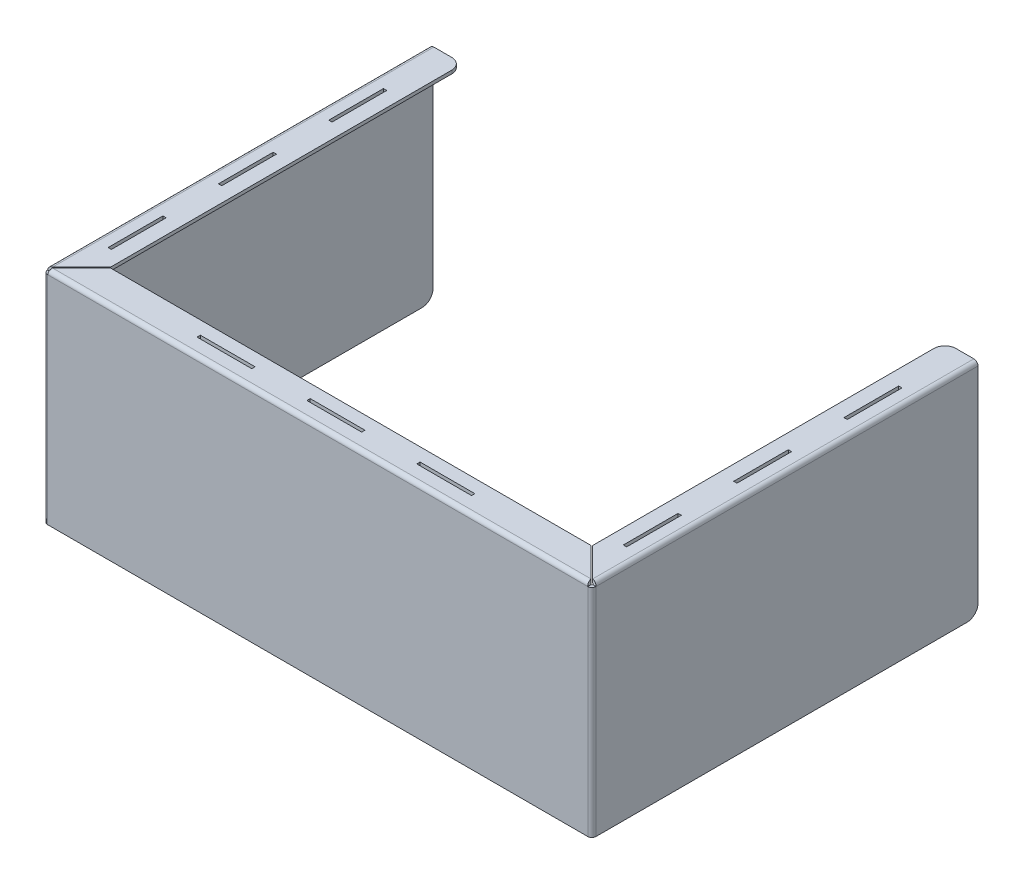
ISO-10303-21;
HEADER;
FILE_DESCRIPTION(('STEP AP214'),'2;1');
FILE_NAME('part.step','',(''),(''),'','','');
FILE_SCHEMA(('AUTOMOTIVE_DESIGN { 1 0 10303 214 1 1 1 1 }'));
ENDSEC;
DATA;
#1=APPLICATION_CONTEXT('core data for automotive mechanical design processes');
#2=APPLICATION_PROTOCOL_DEFINITION('international standard','automotive_design',2000,#1);
#3=PRODUCT_CONTEXT('',#1,'mechanical');
#4=PRODUCT('Part','Part','',(#3));
#5=PRODUCT_RELATED_PRODUCT_CATEGORY('part','',(#4));
#6=PRODUCT_DEFINITION_FORMATION('','',#4);
#7=PRODUCT_DEFINITION_CONTEXT('part definition',#1,'design');
#8=PRODUCT_DEFINITION('design','',#6,#7);
#9=PRODUCT_DEFINITION_SHAPE('','',#8);
#10=(LENGTH_UNIT() NAMED_UNIT(*) SI_UNIT(.MILLI.,.METRE.));
#11=(NAMED_UNIT(*) PLANE_ANGLE_UNIT() SI_UNIT($,.RADIAN.));
#12=(NAMED_UNIT(*) SI_UNIT($,.STERADIAN.) SOLID_ANGLE_UNIT());
#13=UNCERTAINTY_MEASURE_WITH_UNIT(LENGTH_MEASURE(1.E-05),#10,'distance_accuracy_value','');
#14=(GEOMETRIC_REPRESENTATION_CONTEXT(3) GLOBAL_UNCERTAINTY_ASSIGNED_CONTEXT((#13)) GLOBAL_UNIT_ASSIGNED_CONTEXT((#10,
#11,#12)) REPRESENTATION_CONTEXT('',''));
#15=CARTESIAN_POINT('',(0.,0.,0.));
#16=DIRECTION('',(0.,0.,1.));
#17=DIRECTION('',(1.,0.,0.));
#18=AXIS2_PLACEMENT_3D('',#15,#16,#17);
#19=CARTESIAN_POINT('',(0.,0.,-3.));
#20=DIRECTION('',(0.,0.,-1.));
#21=DIRECTION('',(-1.,0.,0.));
#22=AXIS2_PLACEMENT_3D('',#19,#20,#21);
#23=PLANE('',#22);
#24=DIRECTION('',(0.,-1.,0.));
#25=VECTOR('',#24,1.);
#26=CARTESIAN_POINT('',(-244.7634,200.,-3.00000000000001));
#27=LINE('',#26,#25);
#28=CARTESIAN_POINT('',(-244.7634,196.2634,-3.00000000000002));
#29=VERTEX_POINT('',#28);
#30=CARTESIAN_POINT('',(-244.7634,196.26,-3.));
#31=VERTEX_POINT('',#30);
#32=EDGE_CURVE('E1527',#29,#31,#27,.T.);
#33=ORIENTED_EDGE('',*,*,#32,.F.);
#34=DIRECTION('',(-1.,0.,0.));
#35=VECTOR('',#34,1.);
#36=CARTESIAN_POINT('',(244.7634,196.2634,-3.00000000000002));
#37=LINE('',#36,#35);
#38=CARTESIAN_POINT('',(244.7634,196.2634,-3.00000000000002));
#39=VERTEX_POINT('',#38);
#40=EDGE_CURVE('E1506',#39,#29,#37,.T.);
#41=ORIENTED_EDGE('',*,*,#40,.F.);
#42=DIRECTION('',(0.,1.,0.));
#43=VECTOR('',#42,1.);
#44=CARTESIAN_POINT('',(244.7634,198.13,-3.00000000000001));
#45=LINE('',#44,#43);
#46=CARTESIAN_POINT('',(244.7634,196.26,-3.00000000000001));
#47=VERTEX_POINT('',#46);
#48=EDGE_CURVE('E1467',#47,#39,#45,.T.);
#49=ORIENTED_EDGE('',*,*,#48,.F.);
#50=DIRECTION('',(0.,1.,0.));
#51=VECTOR('',#50,1.);
#52=CARTESIAN_POINT('',(244.7634,0.,-3.00000000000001));
#53=LINE('',#52,#51);
#54=CARTESIAN_POINT('',(244.7634,1.11022302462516E-13,-3.00000000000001));
#55=VERTEX_POINT('',#54);
#56=EDGE_CURVE('E1505',#55,#47,#53,.T.);
#57=ORIENTED_EDGE('',*,*,#56,.F.);
#58=DIRECTION('',(1.,0.,0.));
#59=VECTOR('',#58,1.);
#60=CARTESIAN_POINT('',(-248.5,0.,-3.));
#61=LINE('',#60,#59);
#62=CARTESIAN_POINT('',(-244.7634,0.,-3.00000000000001));
#63=VERTEX_POINT('',#62);
#64=EDGE_CURVE('E1477',#63,#55,#61,.T.);
#65=ORIENTED_EDGE('',*,*,#64,.F.);
#66=DIRECTION('',(0.,-1.,0.));
#67=VECTOR('',#66,1.);
#68=CARTESIAN_POINT('',(-244.7634,200.,-3.00000000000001));
#69=LINE('',#68,#67);
#70=EDGE_CURVE('E1521',#31,#63,#69,.T.);
#71=ORIENTED_EDGE('',*,*,#70,.F.);
#72=EDGE_LOOP('',(#33,#41,#49,#57,#65,#71));
#73=FACE_BOUND('',#72,.T.);
#74=ADVANCED_FACE('F188',(#73),#23,.T.);
#75=CARTESIAN_POINT('',(0.,0.,0.));
#76=DIRECTION('',(0.,0.,-1.));
#77=DIRECTION('',(-1.,0.,0.));
#78=AXIS2_PLACEMENT_3D('',#75,#76,#77);
#79=PLANE('',#78);
#80=DIRECTION('',(-1.,0.,0.));
#81=VECTOR('',#80,1.);
#82=CARTESIAN_POINT('',(244.7634,196.2634,0.));
#83=LINE('',#82,#81);
#84=CARTESIAN_POINT('',(244.7634,196.2634,0.));
#85=VERTEX_POINT('',#84);
#86=CARTESIAN_POINT('',(-244.7634,196.2634,0.));
#87=VERTEX_POINT('',#86);
#88=EDGE_CURVE('E1499',#85,#87,#83,.T.);
#89=ORIENTED_EDGE('',*,*,#88,.T.);
#90=DIRECTION('',(0.,-1.,0.));
#91=VECTOR('',#90,1.);
#92=CARTESIAN_POINT('',(-244.7634,200.,0.));
#93=LINE('',#92,#91);
#94=CARTESIAN_POINT('',(-244.7634,196.26,0.));
#95=VERTEX_POINT('',#94);
#96=EDGE_CURVE('E1502',#87,#95,#93,.T.);
#97=ORIENTED_EDGE('',*,*,#96,.T.);
#98=DIRECTION('',(0.,-1.,0.));
#99=VECTOR('',#98,1.);
#100=CARTESIAN_POINT('',(-244.7634,200.,0.));
#101=LINE('',#100,#99);
#102=CARTESIAN_POINT('',(-244.7634,0.,0.));
#103=VERTEX_POINT('',#102);
#104=EDGE_CURVE('E197',#95,#103,#101,.T.);
#105=ORIENTED_EDGE('',*,*,#104,.T.);
#106=DIRECTION('',(1.,0.,0.));
#107=VECTOR('',#106,1.);
#108=CARTESIAN_POINT('',(-248.5,0.,0.));
#109=LINE('',#108,#107);
#110=CARTESIAN_POINT('',(244.7634,0.,0.));
#111=VERTEX_POINT('',#110);
#112=EDGE_CURVE('E1466',#103,#111,#109,.T.);
#113=ORIENTED_EDGE('',*,*,#112,.T.);
#114=DIRECTION('',(0.,1.,0.));
#115=VECTOR('',#114,1.);
#116=CARTESIAN_POINT('',(244.7634,0.,0.));
#117=LINE('',#116,#115);
#118=CARTESIAN_POINT('',(244.7634,196.26,0.));
#119=VERTEX_POINT('',#118);
#120=EDGE_CURVE('E1516',#111,#119,#117,.T.);
#121=ORIENTED_EDGE('',*,*,#120,.T.);
#122=DIRECTION('',(0.,1.,0.));
#123=VECTOR('',#122,1.);
#124=CARTESIAN_POINT('',(244.7634,0.,0.));
#125=LINE('',#124,#123);
#126=EDGE_CURVE('E1462',#119,#85,#125,.T.);
#127=ORIENTED_EDGE('',*,*,#126,.T.);
#128=EDGE_LOOP('',(#89,#97,#105,#113,#121,#127));
#129=FACE_BOUND('',#128,.T.);
#130=ADVANCED_FACE('F1489',(#129),#79,.F.);
#131=CARTESIAN_POINT('',(-248.5,0.,-3.));
#132=DIRECTION('',(0.,-1.,0.));
#133=DIRECTION('',(0.,0.,-1.));
#134=AXIS2_PLACEMENT_3D('',#131,#132,#133);
#135=PLANE('',#134);
#136=ORIENTED_EDGE('',*,*,#64,.T.);
#137=DIRECTION('',(0.,0.,1.));
#138=VECTOR('',#137,1.);
#139=CARTESIAN_POINT('',(244.7634,0.,-3.00000000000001));
#140=LINE('',#139,#138);
#141=EDGE_CURVE('E1518',#55,#111,#140,.T.);
#142=ORIENTED_EDGE('',*,*,#141,.T.);
#143=ORIENTED_EDGE('',*,*,#112,.F.);
#144=DIRECTION('',(0.,0.,1.));
#145=VECTOR('',#144,1.);
#146=CARTESIAN_POINT('',(-244.7634,0.,-3.00000000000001));
#147=LINE('',#146,#145);
#148=EDGE_CURVE('E1523',#63,#103,#147,.T.);
#149=ORIENTED_EDGE('',*,*,#148,.F.);
#150=EDGE_LOOP('',(#136,#142,#143,#149));
#151=FACE_BOUND('',#150,.T.);
#152=ADVANCED_FACE('F190',(#151),#135,.T.);
#153=CARTESIAN_POINT('',(-244.7634,200.,0.));
#154=DIRECTION('',(1.,0.,0.));
#155=DIRECTION('',(0.,-1.,0.));
#156=AXIS2_PLACEMENT_3D('',#153,#154,#155);
#157=PLANE('',#156);
#158=ORIENTED_EDGE('',*,*,#32,.T.);
#159=DIRECTION('',(0.,0.,1.));
#160=VECTOR('',#159,1.);
#161=CARTESIAN_POINT('',(-244.7634,196.26,0.));
#162=LINE('',#161,#160);
#163=EDGE_CURVE('E13',#31,#95,#162,.T.);
#164=ORIENTED_EDGE('',*,*,#163,.T.);
#165=ORIENTED_EDGE('',*,*,#96,.F.);
#166=CARTESIAN_POINT('',(-244.7634,196.2634,-3.00000000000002));
#167=CARTESIAN_POINT('',(-244.7634,196.2634,0.));
#168=B_SPLINE_CURVE_WITH_KNOTS('',1,(#166,#167),.UNSPECIFIED.,.F.,.F.,(2,2),(0.,1.),.UNSPECIFIED.);
#169=EDGE_CURVE('E1448',#29,#87,#168,.T.);
#170=ORIENTED_EDGE('',*,*,#169,.F.);
#171=EDGE_LOOP('',(#158,#164,#165,#170));
#172=FACE_BOUND('',#171,.T.);
#173=ADVANCED_FACE('F1421',(#172),#157,.F.);
#174=CARTESIAN_POINT('',(244.7634,0.,0.));
#175=DIRECTION('',(-1.,0.,0.));
#176=DIRECTION('',(0.,1.,0.));
#177=AXIS2_PLACEMENT_3D('',#174,#175,#176);
#178=PLANE('',#177);
#179=ORIENTED_EDGE('',*,*,#126,.F.);
#180=DIRECTION('',(0.,0.,1.));
#181=VECTOR('',#180,1.);
#182=CARTESIAN_POINT('',(244.7634,196.26,0.));
#183=LINE('',#182,#181);
#184=EDGE_CURVE('E1514',#47,#119,#183,.T.);
#185=ORIENTED_EDGE('',*,*,#184,.F.);
#186=ORIENTED_EDGE('',*,*,#48,.T.);
#187=CARTESIAN_POINT('',(244.7634,196.2634,0.));
#188=CARTESIAN_POINT('',(244.7634,196.2634,-3.00000000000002));
#189=B_SPLINE_CURVE_WITH_KNOTS('',1,(#187,#188),.UNSPECIFIED.,.F.,.F.,(2,2),(0.,1.),.UNSPECIFIED.);
#190=EDGE_CURVE('E1473',#39,#85,#189,.F.);
#191=ORIENTED_EDGE('',*,*,#190,.T.);
#192=EDGE_LOOP('',(#179,#185,#186,#191));
#193=FACE_BOUND('',#192,.T.);
#194=ADVANCED_FACE('F1479',(#193),#178,.F.);
#195=CARTESIAN_POINT('',(244.056293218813,200.,-3.73659999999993));
#196=CARTESIAN_POINT('',(244.115229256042,200.,-3.24739327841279));
#197=CARTESIAN_POINT('',(244.174144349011,199.902746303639,-2.75855285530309));
#198=CARTESIAN_POINT('',(244.291995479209,199.528390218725,-1.85477731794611));
#199=CARTESIAN_POINT('',(244.350921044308,199.251435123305,-1.44028472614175));
#200=CARTESIAN_POINT('',(244.468772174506,198.559715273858,-0.748564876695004));
#201=CARTESIAN_POINT('',(244.527697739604,198.145222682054,-0.471609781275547));
#202=CARTESIAN_POINT('',(244.645548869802,197.241447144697,-0.0972536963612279));
#203=CARTESIAN_POINT('',(244.704463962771,196.752606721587,0.));
#204=CARTESIAN_POINT('',(244.7634,196.2634,0.));
#205=CARTESIAN_POINT('',(244.056293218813,197.,-3.7366));
#206=CARTESIAN_POINT('',(244.115226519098,197.,-3.64016662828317));
#207=CARTESIAN_POINT('',(244.174144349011,196.980828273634,-3.54379650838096));
#208=CARTESIAN_POINT('',(244.291995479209,196.907031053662,-3.36563425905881));
#209=CARTESIAN_POINT('',(244.350921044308,196.852434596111,-3.2839248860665));
#210=CARTESIAN_POINT('',(244.468772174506,196.716075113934,-3.14756540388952));
#211=CARTESIAN_POINT('',(244.527697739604,196.634365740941,-3.09296894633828));
#212=CARTESIAN_POINT('',(244.645548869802,196.456203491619,-3.01917172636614));
#213=CARTESIAN_POINT('',(244.704466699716,196.359833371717,-3.00000000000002));
#214=CARTESIAN_POINT('',(244.7634,196.2634,-3.00000000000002));
#215=B_SPLINE_SURFACE_WITH_KNOTS('',1,3,((#195,#196,#197,#198,#199,#200,#201,#202,#203,#204),
(#205,#206,#207,#208,#209,#210,#211,#212,#213,#214)),.UNSPECIFIED.,.F.,.F.,.F.,(2,2),(4,2,2,2,
4),(0.,1.),(0.,0.25,0.5,0.75,1.),.UNSPECIFIED.);
#216=CARTESIAN_POINT('',(244.056293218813,197.,-3.7366));
#217=CARTESIAN_POINT('',(244.056293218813,200.,-3.73659999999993));
#218=B_SPLINE_CURVE_WITH_KNOTS('',1,(#216,#217),.UNSPECIFIED.,.F.,.F.,(2,2),(0.,1.),.UNSPECIFIED.);
#219=CARTESIAN_POINT('',(244.056293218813,200.,-3.73660000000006));
#220=VERTEX_POINT('',#219);
#221=CARTESIAN_POINT('',(244.056293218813,197.,-3.7366));
#222=VERTEX_POINT('',#221);
#223=EDGE_CURVE('E1216',#220,#222,#218,.F.);
#224=CARTESIAN_POINT('',(244.056293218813,200.,-3.73659999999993));
#225=CARTESIAN_POINT('',(244.115229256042,200.,-3.24739327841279));
#226=CARTESIAN_POINT('',(244.174144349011,199.902746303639,-2.75855285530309));
#227=CARTESIAN_POINT('',(244.291995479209,199.528390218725,-1.85477731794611));
#228=CARTESIAN_POINT('',(244.350921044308,199.251435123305,-1.44028472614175));
#229=CARTESIAN_POINT('',(244.468772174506,198.559715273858,-0.748564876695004));
#230=CARTESIAN_POINT('',(244.527697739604,198.145222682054,-0.471609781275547));
#231=CARTESIAN_POINT('',(244.645548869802,197.241447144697,-0.0972536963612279));
#232=CARTESIAN_POINT('',(244.704463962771,196.752606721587,0.));
#233=CARTESIAN_POINT('',(244.7634,196.2634,0.));
#234=B_SPLINE_CURVE_WITH_KNOTS('',3,(#224,#225,#226,#227,#228,#229,#230,#231,#232,#233),
.UNSPECIFIED.,.F.,.F.,(4,2,2,2,4),(0.,0.25,0.5,0.75,1.),.UNSPECIFIED.);
#235=EDGE_CURVE('E1366',#220,#85,#234,.T.);
#236=CARTESIAN_POINT('',(244.7634,196.2634,-3.00000000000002));
#237=CARTESIAN_POINT('',(244.704466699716,196.359833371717,-3.00000000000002));
#238=CARTESIAN_POINT('',(244.645548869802,196.456203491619,-3.01917172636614));
#239=CARTESIAN_POINT('',(244.527697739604,196.634365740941,-3.09296894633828));
#240=CARTESIAN_POINT('',(244.468772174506,196.716075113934,-3.14756540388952));
#241=CARTESIAN_POINT('',(244.350921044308,196.852434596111,-3.2839248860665));
#242=CARTESIAN_POINT('',(244.291995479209,196.907031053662,-3.36563425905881));
#243=CARTESIAN_POINT('',(244.174144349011,196.980828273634,-3.54379650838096));
#244=CARTESIAN_POINT('',(244.115226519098,197.,-3.64016662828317));
#245=CARTESIAN_POINT('',(244.056293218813,197.,-3.7366));
#246=B_SPLINE_CURVE_WITH_KNOTS('',3,(#236,#237,#238,#239,#240,#241,#242,#243,#244,#245),
.UNSPECIFIED.,.F.,.F.,(4,2,2,2,4),(0.,0.25,0.5,0.75,1.),.UNSPECIFIED.);
#247=EDGE_CURVE('E1360',#222,#39,#246,.F.);
#248=ORIENTED_EDGE('',*,*,#223,.F.);
#249=ORIENTED_EDGE('',*,*,#235,.T.);
#250=ORIENTED_EDGE('',*,*,#190,.F.);
#251=ORIENTED_EDGE('',*,*,#247,.F.);
#252=EDGE_LOOP('',(#248,#249,#250,#251));
#253=FACE_BOUND('',#252,.T.);
#254=ADVANCED_FACE('F1381',(#253),#215,.F.);
#255=CARTESIAN_POINT('',(-244.7634,196.2634,0.));
#256=CARTESIAN_POINT('',(-244.704463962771,196.752606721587,0.));
#257=CARTESIAN_POINT('',(-244.645548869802,197.241447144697,-0.0972536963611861));
#258=CARTESIAN_POINT('',(-244.527697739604,198.145222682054,-0.471609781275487));
#259=CARTESIAN_POINT('',(-244.468772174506,198.559715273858,-0.748564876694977));
#260=CARTESIAN_POINT('',(-244.350921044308,199.251435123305,-1.44028472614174));
#261=CARTESIAN_POINT('',(-244.291995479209,199.528390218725,-1.8547773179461));
#262=CARTESIAN_POINT('',(-244.174144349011,199.902746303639,-2.7585528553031));
#263=CARTESIAN_POINT('',(-244.115229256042,200.,-3.24739327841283));
#264=CARTESIAN_POINT('',(-244.056293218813,200.,-3.73659999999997));
#265=CARTESIAN_POINT('',(-244.7634,196.2634,-3.00000000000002));
#266=CARTESIAN_POINT('',(-244.704466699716,196.359833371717,-3.00000000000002));
#267=CARTESIAN_POINT('',(-244.645548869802,196.456203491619,-3.01917172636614));
#268=CARTESIAN_POINT('',(-244.527697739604,196.634365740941,-3.09296894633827));
#269=CARTESIAN_POINT('',(-244.468772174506,196.716075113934,-3.14756540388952));
#270=CARTESIAN_POINT('',(-244.350921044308,196.852434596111,-3.28392488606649));
#271=CARTESIAN_POINT('',(-244.291995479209,196.907031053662,-3.36563425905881));
#272=CARTESIAN_POINT('',(-244.174144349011,196.980828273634,-3.54379650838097));
#273=CARTESIAN_POINT('',(-244.115226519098,197.,-3.64016662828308));
#274=CARTESIAN_POINT('',(-244.056293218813,197.,-3.73660000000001));
#275=B_SPLINE_SURFACE_WITH_KNOTS('',1,3,((#255,#256,#257,#258,#259,#260,#261,#262,#263,#264),
(#265,#266,#267,#268,#269,#270,#271,#272,#273,#274)),.UNSPECIFIED.,.F.,.F.,.F.,(2,2),(4,2,2,2,
4),(0.,1.),(0.,0.25,0.5,0.75,1.),.UNSPECIFIED.);
#276=CARTESIAN_POINT('',(-244.7634,196.2634,0.));
#277=CARTESIAN_POINT('',(-244.704463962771,196.752606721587,0.));
#278=CARTESIAN_POINT('',(-244.645548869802,197.241447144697,-0.0972536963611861));
#279=CARTESIAN_POINT('',(-244.527697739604,198.145222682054,-0.471609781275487));
#280=CARTESIAN_POINT('',(-244.468772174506,198.559715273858,-0.748564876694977));
#281=CARTESIAN_POINT('',(-244.350921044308,199.251435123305,-1.44028472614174));
#282=CARTESIAN_POINT('',(-244.291995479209,199.528390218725,-1.8547773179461));
#283=CARTESIAN_POINT('',(-244.174144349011,199.902746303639,-2.7585528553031));
#284=CARTESIAN_POINT('',(-244.115229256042,200.,-3.24739327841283));
#285=CARTESIAN_POINT('',(-244.056293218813,200.,-3.73659999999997));
#286=B_SPLINE_CURVE_WITH_KNOTS('',3,(#276,#277,#278,#279,#280,#281,#282,#283,#284,#285),
.UNSPECIFIED.,.F.,.F.,(4,2,2,2,4),(0.,0.25,0.5,0.75,1.),.UNSPECIFIED.);
#287=CARTESIAN_POINT('',(-244.056293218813,200.,-3.73660000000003));
#288=VERTEX_POINT('',#287);
#289=EDGE_CURVE('E2587',#87,#288,#286,.T.);
#290=CARTESIAN_POINT('',(-244.056293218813,200.,-3.73659999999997));
#291=CARTESIAN_POINT('',(-244.056293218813,197.,-3.73660000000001));
#292=B_SPLINE_CURVE_WITH_KNOTS('',1,(#290,#291),.UNSPECIFIED.,.F.,.F.,(2,2),(0.,1.),.UNSPECIFIED.);
#293=CARTESIAN_POINT('',(-244.056293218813,197.,-3.73660000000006));
#294=VERTEX_POINT('',#293);
#295=EDGE_CURVE('E1174',#288,#294,#292,.T.);
#296=CARTESIAN_POINT('',(-244.056293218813,197.,-3.73660000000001));
#297=CARTESIAN_POINT('',(-244.115226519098,197.,-3.64016662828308));
#298=CARTESIAN_POINT('',(-244.174144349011,196.980828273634,-3.54379650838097));
#299=CARTESIAN_POINT('',(-244.291995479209,196.907031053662,-3.36563425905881));
#300=CARTESIAN_POINT('',(-244.350921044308,196.852434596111,-3.28392488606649));
#301=CARTESIAN_POINT('',(-244.468772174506,196.716075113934,-3.14756540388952));
#302=CARTESIAN_POINT('',(-244.527697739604,196.634365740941,-3.09296894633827));
#303=CARTESIAN_POINT('',(-244.645548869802,196.456203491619,-3.01917172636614));
#304=CARTESIAN_POINT('',(-244.704466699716,196.359833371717,-3.00000000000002));
#305=CARTESIAN_POINT('',(-244.7634,196.2634,-3.00000000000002));
#306=B_SPLINE_CURVE_WITH_KNOTS('',3,(#296,#297,#298,#299,#300,#301,#302,#303,#304,#305),
.UNSPECIFIED.,.F.,.F.,(4,2,2,2,4),(0.,0.25,0.5,0.75,1.),.UNSPECIFIED.);
#307=EDGE_CURVE('E1403',#29,#294,#306,.F.);
#308=ORIENTED_EDGE('',*,*,#289,.T.);
#309=ORIENTED_EDGE('',*,*,#295,.T.);
#310=ORIENTED_EDGE('',*,*,#307,.F.);
#311=ORIENTED_EDGE('',*,*,#169,.T.);
#312=EDGE_LOOP('',(#308,#309,#310,#311));
#313=FACE_BOUND('',#312,.T.);
#314=ADVANCED_FACE('F1410',(#313),#275,.F.);
#315=CARTESIAN_POINT('',(-489.548599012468,196.2634,-3.73660000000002));
#316=DIRECTION('',(1.,0.,0.));
#317=DIRECTION('',(0.,0.,-1.));
#318=AXIS2_PLACEMENT_3D('',#315,#316,#317);
#319=CYLINDRICAL_SURFACE('',#318,0.7366);
#320=ORIENTED_EDGE('',*,*,#40,.T.);
#321=ORIENTED_EDGE('',*,*,#307,.T.);
#322=DIRECTION('',(1.,0.,0.));
#323=VECTOR('',#322,1.);
#324=CARTESIAN_POINT('',(-244.7634,197.,-3.73660000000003));
#325=LINE('',#324,#323);
#326=EDGE_CURVE('E1166',#294,#222,#325,.T.);
#327=ORIENTED_EDGE('',*,*,#326,.T.);
#328=ORIENTED_EDGE('',*,*,#247,.T.);
#329=EDGE_LOOP('',(#320,#321,#327,#328));
#330=FACE_BOUND('',#329,.T.);
#331=ADVANCED_FACE('F1203',(#330),#319,.F.);
#332=CARTESIAN_POINT('',(-489.548599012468,196.2634,-3.73660000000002));
#333=DIRECTION('',(1.,0.,0.));
#334=DIRECTION('',(0.,0.,-1.));
#335=AXIS2_PLACEMENT_3D('',#332,#333,#334);
#336=CYLINDRICAL_SURFACE('',#335,3.7366);
#337=ORIENTED_EDGE('',*,*,#88,.F.);
#338=ORIENTED_EDGE('',*,*,#235,.F.);
#339=DIRECTION('',(-1.,0.,0.));
#340=VECTOR('',#339,1.);
#341=CARTESIAN_POINT('',(-244.7634,200.,-3.73660000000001));
#342=LINE('',#341,#340);
#343=EDGE_CURVE('E1340',#220,#288,#342,.T.);
#344=ORIENTED_EDGE('',*,*,#343,.T.);
#345=ORIENTED_EDGE('',*,*,#289,.F.);
#346=EDGE_LOOP('',(#337,#338,#344,#345));
#347=FACE_BOUND('',#346,.T.);
#348=ADVANCED_FACE('F1371',(#347),#336,.T.);
#349=CARTESIAN_POINT('',(-244.7634,200.,-30.));
#350=DIRECTION('',(0.,0.,1.));
#351=DIRECTION('',(0.,-1.,0.));
#352=AXIS2_PLACEMENT_3D('',#349,#350,#351);
#353=PLANE('',#352);
#354=DIRECTION('',(0.,-1.,0.));
#355=VECTOR('',#354,1.);
#356=CARTESIAN_POINT('',(-217.792893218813,200.,-30.));
#357=LINE('',#356,#355);
#358=CARTESIAN_POINT('',(-217.792893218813,200.,-30.));
#359=VERTEX_POINT('',#358);
#360=CARTESIAN_POINT('',(-217.792893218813,197.,-30.0000000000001));
#361=VERTEX_POINT('',#360);
#362=EDGE_CURVE('E1225',#359,#361,#357,.T.);
#363=ORIENTED_EDGE('',*,*,#362,.F.);
#364=DIRECTION('',(-1.,0.,0.));
#365=VECTOR('',#364,1.);
#366=CARTESIAN_POINT('',(0.,200.,-30.));
#367=LINE('',#366,#365);
#368=CARTESIAN_POINT('',(217.792893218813,200.,-30.));
#369=VERTEX_POINT('',#368);
#370=EDGE_CURVE('E1222',#369,#359,#367,.T.);
#371=ORIENTED_EDGE('',*,*,#370,.F.);
#372=DIRECTION('',(0.,1.,0.));
#373=VECTOR('',#372,1.);
#374=CARTESIAN_POINT('',(217.792893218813,200.,-30.));
#375=LINE('',#374,#373);
#376=CARTESIAN_POINT('',(217.792893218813,197.,-30.0000000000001));
#377=VERTEX_POINT('',#376);
#378=EDGE_CURVE('E1217',#377,#369,#375,.T.);
#379=ORIENTED_EDGE('',*,*,#378,.F.);
#380=DIRECTION('',(1.,0.,0.));
#381=VECTOR('',#380,1.);
#382=CARTESIAN_POINT('',(-244.7634,197.,-30.0000000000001));
#383=LINE('',#382,#381);
#384=EDGE_CURVE('E1337',#377,#361,#383,.F.);
#385=ORIENTED_EDGE('',*,*,#384,.T.);
#386=EDGE_LOOP('',(#363,#371,#379,#385));
#387=FACE_BOUND('',#386,.T.);
#388=ADVANCED_FACE('F1380',(#387),#353,.F.);
#389=CARTESIAN_POINT('',(-24.8,-0.00100000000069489,-18.));
#390=DIRECTION('',(0.,0.,-1.));
#391=DIRECTION('',(0.,1.,0.));
#392=AXIS2_PLACEMENT_3D('',#389,#390,#391);
#393=PLANE('',#392);
#394=DIRECTION('',(0.,1.,0.));
#395=VECTOR('',#394,1.);
#396=CARTESIAN_POINT('',(24.8,-0.00100000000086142,-18.));
#397=LINE('',#396,#395);
#398=CARTESIAN_POINT('',(24.8000000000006,197.,-18.));
#399=VERTEX_POINT('',#398);
#400=CARTESIAN_POINT('',(24.8000000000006,200.000000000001,-18.));
#401=VERTEX_POINT('',#400);
#402=EDGE_CURVE('E1335',#399,#401,#397,.T.);
#403=ORIENTED_EDGE('',*,*,#402,.T.);
#404=DIRECTION('',(-1.,0.,0.));
#405=VECTOR('',#404,1.);
#406=CARTESIAN_POINT('',(-24.7999999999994,200.000000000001,-18.));
#407=LINE('',#406,#405);
#408=CARTESIAN_POINT('',(-24.7999999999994,200.000000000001,-18.));
#409=VERTEX_POINT('',#408);
#410=EDGE_CURVE('E1332',#401,#409,#407,.T.);
#411=ORIENTED_EDGE('',*,*,#410,.T.);
#412=DIRECTION('',(0.,1.,0.));
#413=VECTOR('',#412,1.);
#414=CARTESIAN_POINT('',(-24.8,-0.00100000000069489,-18.));
#415=LINE('',#414,#413);
#416=CARTESIAN_POINT('',(-24.8,197.,-18.));
#417=VERTEX_POINT('',#416);
#418=EDGE_CURVE('E1319',#417,#409,#415,.T.);
#419=ORIENTED_EDGE('',*,*,#418,.F.);
#420=DIRECTION('',(-1.,0.,0.));
#421=VECTOR('',#420,1.);
#422=CARTESIAN_POINT('',(-24.8,197.,-18.));
#423=LINE('',#422,#421);
#424=EDGE_CURVE('E1239',#399,#417,#423,.T.);
#425=ORIENTED_EDGE('',*,*,#424,.F.);
#426=EDGE_LOOP('',(#403,#411,#419,#425));
#427=FACE_BOUND('',#426,.T.);
#428=ADVANCED_FACE('F2444',(#427),#393,.F.);
#429=CARTESIAN_POINT('',(24.8,-0.00100000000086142,-18.));
#430=DIRECTION('',(1.,0.,0.));
#431=DIRECTION('',(0.,1.,0.));
#432=AXIS2_PLACEMENT_3D('',#429,#430,#431);
#433=PLANE('',#432);
#434=DIRECTION('',(0.,1.,0.));
#435=VECTOR('',#434,1.);
#436=CARTESIAN_POINT('',(24.8,-0.00100000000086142,-15.));
#437=LINE('',#436,#435);
#438=CARTESIAN_POINT('',(24.8000000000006,197.,-15.));
#439=VERTEX_POINT('',#438);
#440=CARTESIAN_POINT('',(24.8000000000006,200.000000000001,-15.));
#441=VERTEX_POINT('',#440);
#442=EDGE_CURVE('E1330',#439,#441,#437,.T.);
#443=ORIENTED_EDGE('',*,*,#442,.T.);
#444=DIRECTION('',(0.,0.,-1.));
#445=VECTOR('',#444,1.);
#446=CARTESIAN_POINT('',(24.8000000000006,200.000000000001,-18.));
#447=LINE('',#446,#445);
#448=EDGE_CURVE('E1327',#441,#401,#447,.T.);
#449=ORIENTED_EDGE('',*,*,#448,.T.);
#450=ORIENTED_EDGE('',*,*,#402,.F.);
#451=DIRECTION('',(0.,0.,-1.));
#452=VECTOR('',#451,1.);
#453=CARTESIAN_POINT('',(24.8000000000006,197.,-17.9999999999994));
#454=LINE('',#453,#452);
#455=EDGE_CURVE('E1244',#439,#399,#454,.T.);
#456=ORIENTED_EDGE('',*,*,#455,.F.);
#457=EDGE_LOOP('',(#443,#449,#450,#456));
#458=FACE_BOUND('',#457,.T.);
#459=ADVANCED_FACE('F2433',(#458),#433,.F.);
#460=CARTESIAN_POINT('',(-24.8,-0.00100000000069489,-15.));
#461=DIRECTION('',(0.,0.,1.));
#462=DIRECTION('',(0.,-1.,0.));
#463=AXIS2_PLACEMENT_3D('',#460,#461,#462);
#464=PLANE('',#463);
#465=DIRECTION('',(0.,1.,0.));
#466=VECTOR('',#465,1.);
#467=CARTESIAN_POINT('',(-24.8,-0.00100000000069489,-15.));
#468=LINE('',#467,#466);
#469=CARTESIAN_POINT('',(-24.8,197.,-15.));
#470=VERTEX_POINT('',#469);
#471=CARTESIAN_POINT('',(-24.7999999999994,200.,-15.));
#472=VERTEX_POINT('',#471);
#473=EDGE_CURVE('E1324',#470,#472,#468,.T.);
#474=ORIENTED_EDGE('',*,*,#473,.T.);
#475=DIRECTION('',(1.,0.,0.));
#476=VECTOR('',#475,1.);
#477=CARTESIAN_POINT('',(-24.7999999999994,200.000000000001,-15.));
#478=LINE('',#477,#476);
#479=EDGE_CURVE('E1321',#472,#441,#478,.T.);
#480=ORIENTED_EDGE('',*,*,#479,.T.);
#481=ORIENTED_EDGE('',*,*,#442,.F.);
#482=DIRECTION('',(1.,0.,0.));
#483=VECTOR('',#482,1.);
#484=CARTESIAN_POINT('',(-24.8,197.,-15.));
#485=LINE('',#484,#483);
#486=EDGE_CURVE('E1247',#470,#439,#485,.T.);
#487=ORIENTED_EDGE('',*,*,#486,.F.);
#488=EDGE_LOOP('',(#474,#480,#481,#487));
#489=FACE_BOUND('',#488,.T.);
#490=ADVANCED_FACE('F2422',(#489),#464,.F.);
#491=CARTESIAN_POINT('',(-24.8,-0.00100000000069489,-18.));
#492=DIRECTION('',(-1.,0.,0.));
#493=DIRECTION('',(0.,-1.,0.));
#494=AXIS2_PLACEMENT_3D('',#491,#492,#493);
#495=PLANE('',#494);
#496=ORIENTED_EDGE('',*,*,#418,.T.);
#497=DIRECTION('',(0.,0.,1.));
#498=VECTOR('',#497,1.);
#499=CARTESIAN_POINT('',(-24.7999999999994,200.000000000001,-18.));
#500=LINE('',#499,#498);
#501=EDGE_CURVE('E1317',#409,#472,#500,.T.);
#502=ORIENTED_EDGE('',*,*,#501,.T.);
#503=ORIENTED_EDGE('',*,*,#473,.F.);
#504=DIRECTION('',(0.,0.,1.));
#505=VECTOR('',#504,1.);
#506=CARTESIAN_POINT('',(-24.7999999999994,197.,-17.9999999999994));
#507=LINE('',#506,#505);
#508=EDGE_CURVE('E1250',#417,#470,#507,.T.);
#509=ORIENTED_EDGE('',*,*,#508,.F.);
#510=EDGE_LOOP('',(#496,#502,#503,#509));
#511=FACE_BOUND('',#510,.T.);
#512=ADVANCED_FACE('F2411',(#511),#495,.F.);
#513=CARTESIAN_POINT('',(-124.4,-0.00100000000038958,-18.));
#514=DIRECTION('',(0.,0.,-1.));
#515=DIRECTION('',(0.,1.,0.));
#516=AXIS2_PLACEMENT_3D('',#513,#514,#515);
#517=PLANE('',#516);
#518=DIRECTION('',(0.,1.,0.));
#519=VECTOR('',#518,1.);
#520=CARTESIAN_POINT('',(-74.8,-0.00100000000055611,-18.));
#521=LINE('',#520,#519);
#522=CARTESIAN_POINT('',(-74.7999999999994,197.,-18.));
#523=VERTEX_POINT('',#522);
#524=CARTESIAN_POINT('',(-74.7999999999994,200.000000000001,-18.));
#525=VERTEX_POINT('',#524);
#526=EDGE_CURVE('E1315',#523,#525,#521,.T.);
#527=ORIENTED_EDGE('',*,*,#526,.T.);
#528=DIRECTION('',(-1.,0.,0.));
#529=VECTOR('',#528,1.);
#530=CARTESIAN_POINT('',(-124.399999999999,200.000000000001,-18.));
#531=LINE('',#530,#529);
#532=CARTESIAN_POINT('',(-124.399999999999,200.000000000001,-18.));
#533=VERTEX_POINT('',#532);
#534=EDGE_CURVE('E1312',#525,#533,#531,.T.);
#535=ORIENTED_EDGE('',*,*,#534,.T.);
#536=DIRECTION('',(0.,1.,0.));
#537=VECTOR('',#536,1.);
#538=CARTESIAN_POINT('',(-124.4,-0.00100000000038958,-18.));
#539=LINE('',#538,#537);
#540=CARTESIAN_POINT('',(-124.4,197.,-18.));
#541=VERTEX_POINT('',#540);
#542=EDGE_CURVE('E1299',#541,#533,#539,.T.);
#543=ORIENTED_EDGE('',*,*,#542,.F.);
#544=DIRECTION('',(-1.,0.,0.));
#545=VECTOR('',#544,1.);
#546=CARTESIAN_POINT('',(-124.4,197.,-18.));
#547=LINE('',#546,#545);
#548=EDGE_CURVE('E1253',#523,#541,#547,.T.);
#549=ORIENTED_EDGE('',*,*,#548,.F.);
#550=EDGE_LOOP('',(#527,#535,#543,#549));
#551=FACE_BOUND('',#550,.T.);
#552=ADVANCED_FACE('F2400',(#551),#517,.F.);
#553=CARTESIAN_POINT('',(-74.8,-0.00100000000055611,-18.));
#554=DIRECTION('',(1.,0.,0.));
#555=DIRECTION('',(0.,1.,0.));
#556=AXIS2_PLACEMENT_3D('',#553,#554,#555);
#557=PLANE('',#556);
#558=DIRECTION('',(0.,1.,0.));
#559=VECTOR('',#558,1.);
#560=CARTESIAN_POINT('',(-74.8,-0.00100000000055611,-15.));
#561=LINE('',#560,#559);
#562=CARTESIAN_POINT('',(-74.7999999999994,197.,-15.));
#563=VERTEX_POINT('',#562);
#564=CARTESIAN_POINT('',(-74.7999999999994,200.000000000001,-15.));
#565=VERTEX_POINT('',#564);
#566=EDGE_CURVE('E1310',#563,#565,#561,.T.);
#567=ORIENTED_EDGE('',*,*,#566,.T.);
#568=DIRECTION('',(0.,0.,-1.));
#569=VECTOR('',#568,1.);
#570=CARTESIAN_POINT('',(-74.7999999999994,200.000000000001,-18.));
#571=LINE('',#570,#569);
#572=EDGE_CURVE('E1307',#565,#525,#571,.T.);
#573=ORIENTED_EDGE('',*,*,#572,.T.);
#574=ORIENTED_EDGE('',*,*,#526,.F.);
#575=DIRECTION('',(0.,0.,-1.));
#576=VECTOR('',#575,1.);
#577=CARTESIAN_POINT('',(-74.7999999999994,197.,-17.9999999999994));
#578=LINE('',#577,#576);
#579=EDGE_CURVE('E1256',#563,#523,#578,.T.);
#580=ORIENTED_EDGE('',*,*,#579,.F.);
#581=EDGE_LOOP('',(#567,#573,#574,#580));
#582=FACE_BOUND('',#581,.T.);
#583=ADVANCED_FACE('F2389',(#582),#557,.F.);
#584=CARTESIAN_POINT('',(-124.4,-0.00100000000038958,-15.));
#585=DIRECTION('',(0.,0.,1.));
#586=DIRECTION('',(1.,0.,0.));
#587=AXIS2_PLACEMENT_3D('',#584,#585,#586);
#588=PLANE('',#587);
#589=DIRECTION('',(0.,1.,0.));
#590=VECTOR('',#589,1.);
#591=CARTESIAN_POINT('',(-124.4,-0.00100000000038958,-15.));
#592=LINE('',#591,#590);
#593=CARTESIAN_POINT('',(-124.4,197.,-15.));
#594=VERTEX_POINT('',#593);
#595=CARTESIAN_POINT('',(-124.399999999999,200.,-15.));
#596=VERTEX_POINT('',#595);
#597=EDGE_CURVE('E1304',#594,#596,#592,.T.);
#598=ORIENTED_EDGE('',*,*,#597,.T.);
#599=DIRECTION('',(1.,0.,0.));
#600=VECTOR('',#599,1.);
#601=CARTESIAN_POINT('',(-124.399999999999,200.000000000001,-15.));
#602=LINE('',#601,#600);
#603=EDGE_CURVE('E1301',#596,#565,#602,.T.);
#604=ORIENTED_EDGE('',*,*,#603,.T.);
#605=ORIENTED_EDGE('',*,*,#566,.F.);
#606=DIRECTION('',(1.,0.,0.));
#607=VECTOR('',#606,1.);
#608=CARTESIAN_POINT('',(-124.4,197.,-15.));
#609=LINE('',#608,#607);
#610=EDGE_CURVE('E1259',#594,#563,#609,.T.);
#611=ORIENTED_EDGE('',*,*,#610,.F.);
#612=EDGE_LOOP('',(#598,#604,#605,#611));
#613=FACE_BOUND('',#612,.T.);
#614=ADVANCED_FACE('F2378',(#613),#588,.F.);
#615=CARTESIAN_POINT('',(-124.4,-0.00100000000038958,-18.));
#616=DIRECTION('',(-1.,0.,0.));
#617=DIRECTION('',(0.,-1.,0.));
#618=AXIS2_PLACEMENT_3D('',#615,#616,#617);
#619=PLANE('',#618);
#620=ORIENTED_EDGE('',*,*,#542,.T.);
#621=DIRECTION('',(0.,0.,1.));
#622=VECTOR('',#621,1.);
#623=CARTESIAN_POINT('',(-124.399999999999,200.000000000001,-18.));
#624=LINE('',#623,#622);
#625=EDGE_CURVE('E1297',#533,#596,#624,.T.);
#626=ORIENTED_EDGE('',*,*,#625,.T.);
#627=ORIENTED_EDGE('',*,*,#597,.F.);
#628=DIRECTION('',(0.,0.,1.));
#629=VECTOR('',#628,1.);
#630=CARTESIAN_POINT('',(-124.399999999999,197.,-17.9999999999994));
#631=LINE('',#630,#629);
#632=EDGE_CURVE('E1262',#541,#594,#631,.T.);
#633=ORIENTED_EDGE('',*,*,#632,.F.);
#634=EDGE_LOOP('',(#620,#626,#627,#633));
#635=FACE_BOUND('',#634,.T.);
#636=ADVANCED_FACE('F2367',(#635),#619,.F.);
#637=CARTESIAN_POINT('',(124.4,-0.00100000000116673,-15.));
#638=DIRECTION('',(0.,0.,1.));
#639=DIRECTION('',(0.,-1.,0.));
#640=AXIS2_PLACEMENT_3D('',#637,#638,#639);
#641=PLANE('',#640);
#642=DIRECTION('',(0.,1.,0.));
#643=VECTOR('',#642,1.);
#644=CARTESIAN_POINT('',(74.8,-0.0010000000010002,-15.));
#645=LINE('',#644,#643);
#646=CARTESIAN_POINT('',(74.8000000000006,197.,-15.));
#647=VERTEX_POINT('',#646);
#648=CARTESIAN_POINT('',(74.8000000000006,200.000000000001,-15.));
#649=VERTEX_POINT('',#648);
#650=EDGE_CURVE('E1295',#647,#649,#645,.T.);
#651=ORIENTED_EDGE('',*,*,#650,.T.);
#652=DIRECTION('',(1.,0.,0.));
#653=VECTOR('',#652,1.);
#654=CARTESIAN_POINT('',(124.400000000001,200.,-15.));
#655=LINE('',#654,#653);
#656=CARTESIAN_POINT('',(124.400000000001,200.,-15.));
#657=VERTEX_POINT('',#656);
#658=EDGE_CURVE('E1292',#649,#657,#655,.T.);
#659=ORIENTED_EDGE('',*,*,#658,.T.);
#660=DIRECTION('',(0.,1.,0.));
#661=VECTOR('',#660,1.);
#662=CARTESIAN_POINT('',(124.4,-0.00100000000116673,-15.));
#663=LINE('',#662,#661);
#664=CARTESIAN_POINT('',(124.400000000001,197.,-15.));
#665=VERTEX_POINT('',#664);
#666=EDGE_CURVE('E1279',#665,#657,#663,.T.);
#667=ORIENTED_EDGE('',*,*,#666,.F.);
#668=DIRECTION('',(1.,0.,0.));
#669=VECTOR('',#668,1.);
#670=CARTESIAN_POINT('',(124.4,197.,-15.));
#671=LINE('',#670,#669);
#672=EDGE_CURVE('E1265',#647,#665,#671,.T.);
#673=ORIENTED_EDGE('',*,*,#672,.F.);
#674=EDGE_LOOP('',(#651,#659,#667,#673));
#675=FACE_BOUND('',#674,.T.);
#676=ADVANCED_FACE('F2356',(#675),#641,.F.);
#677=CARTESIAN_POINT('',(74.8,-0.0010000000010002,-18.));
#678=DIRECTION('',(-1.,0.,0.));
#679=DIRECTION('',(0.,-1.,0.));
#680=AXIS2_PLACEMENT_3D('',#677,#678,#679);
#681=PLANE('',#680);
#682=DIRECTION('',(0.,1.,0.));
#683=VECTOR('',#682,1.);
#684=CARTESIAN_POINT('',(74.8,-0.0010000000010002,-18.));
#685=LINE('',#684,#683);
#686=CARTESIAN_POINT('',(74.8000000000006,197.,-18.));
#687=VERTEX_POINT('',#686);
#688=CARTESIAN_POINT('',(74.8000000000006,200.000000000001,-18.));
#689=VERTEX_POINT('',#688);
#690=EDGE_CURVE('E1290',#687,#689,#685,.T.);
#691=ORIENTED_EDGE('',*,*,#690,.T.);
#692=DIRECTION('',(0.,0.,1.));
#693=VECTOR('',#692,1.);
#694=CARTESIAN_POINT('',(74.8000000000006,200.000000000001,-18.));
#695=LINE('',#694,#693);
#696=EDGE_CURVE('E1287',#689,#649,#695,.T.);
#697=ORIENTED_EDGE('',*,*,#696,.T.);
#698=ORIENTED_EDGE('',*,*,#650,.F.);
#699=DIRECTION('',(0.,0.,1.));
#700=VECTOR('',#699,1.);
#701=CARTESIAN_POINT('',(74.8000000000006,197.,-17.9999999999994));
#702=LINE('',#701,#700);
#703=EDGE_CURVE('E1268',#687,#647,#702,.T.);
#704=ORIENTED_EDGE('',*,*,#703,.F.);
#705=EDGE_LOOP('',(#691,#697,#698,#704));
#706=FACE_BOUND('',#705,.T.);
#707=ADVANCED_FACE('F2345',(#706),#681,.F.);
#708=CARTESIAN_POINT('',(124.4,-0.00100000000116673,-18.));
#709=DIRECTION('',(0.,0.,-1.));
#710=DIRECTION('',(0.,1.,0.));
#711=AXIS2_PLACEMENT_3D('',#708,#709,#710);
#712=PLANE('',#711);
#713=DIRECTION('',(0.,1.,0.));
#714=VECTOR('',#713,1.);
#715=CARTESIAN_POINT('',(124.4,-0.00100000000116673,-18.));
#716=LINE('',#715,#714);
#717=CARTESIAN_POINT('',(124.400000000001,197.,-18.));
#718=VERTEX_POINT('',#717);
#719=CARTESIAN_POINT('',(124.400000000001,200.,-18.));
#720=VERTEX_POINT('',#719);
#721=EDGE_CURVE('E1284',#718,#720,#716,.T.);
#722=ORIENTED_EDGE('',*,*,#721,.T.);
#723=DIRECTION('',(-1.,0.,0.));
#724=VECTOR('',#723,1.);
#725=CARTESIAN_POINT('',(124.400000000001,200.,-18.));
#726=LINE('',#725,#724);
#727=EDGE_CURVE('E1281',#720,#689,#726,.T.);
#728=ORIENTED_EDGE('',*,*,#727,.T.);
#729=ORIENTED_EDGE('',*,*,#690,.F.);
#730=DIRECTION('',(-1.,0.,0.));
#731=VECTOR('',#730,1.);
#732=CARTESIAN_POINT('',(124.4,197.,-18.));
#733=LINE('',#732,#731);
#734=EDGE_CURVE('E1271',#718,#687,#733,.T.);
#735=ORIENTED_EDGE('',*,*,#734,.F.);
#736=EDGE_LOOP('',(#722,#728,#729,#735));
#737=FACE_BOUND('',#736,.T.);
#738=ADVANCED_FACE('F2335',(#737),#712,.F.);
#739=CARTESIAN_POINT('',(124.4,-0.00100000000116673,-18.));
#740=DIRECTION('',(1.,0.,0.));
#741=DIRECTION('',(0.,1.,0.));
#742=AXIS2_PLACEMENT_3D('',#739,#740,#741);
#743=PLANE('',#742);
#744=ORIENTED_EDGE('',*,*,#666,.T.);
#745=DIRECTION('',(0.,0.,-1.));
#746=VECTOR('',#745,1.);
#747=CARTESIAN_POINT('',(124.400000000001,200.,-18.));
#748=LINE('',#747,#746);
#749=EDGE_CURVE('E1277',#657,#720,#748,.T.);
#750=ORIENTED_EDGE('',*,*,#749,.T.);
#751=ORIENTED_EDGE('',*,*,#721,.F.);
#752=DIRECTION('',(0.,0.,-1.));
#753=VECTOR('',#752,1.);
#754=CARTESIAN_POINT('',(124.400000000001,197.,-17.9999999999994));
#755=LINE('',#754,#753);
#756=EDGE_CURVE('E1274',#665,#718,#755,.T.);
#757=ORIENTED_EDGE('',*,*,#756,.F.);
#758=EDGE_LOOP('',(#744,#750,#751,#757));
#759=FACE_BOUND('',#758,.T.);
#760=ADVANCED_FACE('F2325',(#759),#743,.F.);
#761=CARTESIAN_POINT('',(0.,197.,5.82867087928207E-13));
#762=DIRECTION('',(0.,-1.,0.));
#763=DIRECTION('',(0.,0.,-1.));
#764=AXIS2_PLACEMENT_3D('',#761,#762,#763);
#765=PLANE('',#764);
#766=ORIENTED_EDGE('',*,*,#756,.T.);
#767=ORIENTED_EDGE('',*,*,#734,.T.);
#768=ORIENTED_EDGE('',*,*,#703,.T.);
#769=ORIENTED_EDGE('',*,*,#672,.T.);
#770=EDGE_LOOP('',(#766,#767,#768,#769));
#771=FACE_BOUND('',#770,.T.);
#772=ORIENTED_EDGE('',*,*,#632,.T.);
#773=ORIENTED_EDGE('',*,*,#610,.T.);
#774=ORIENTED_EDGE('',*,*,#579,.T.);
#775=ORIENTED_EDGE('',*,*,#548,.T.);
#776=EDGE_LOOP('',(#772,#773,#774,#775));
#777=FACE_BOUND('',#776,.T.);
#778=ORIENTED_EDGE('',*,*,#508,.T.);
#779=ORIENTED_EDGE('',*,*,#486,.T.);
#780=ORIENTED_EDGE('',*,*,#455,.T.);
#781=ORIENTED_EDGE('',*,*,#424,.T.);
#782=EDGE_LOOP('',(#778,#779,#780,#781));
#783=FACE_BOUND('',#782,.T.);
#784=ORIENTED_EDGE('',*,*,#326,.F.);
#785=DIRECTION('',(0.707106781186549,0.,-0.707106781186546));
#786=VECTOR('',#785,1.);
#787=CARTESIAN_POINT('',(-123.896446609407,197.,-123.896446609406));
#788=LINE('',#787,#786);
#789=EDGE_CURVE('E1234',#294,#361,#788,.T.);
#790=ORIENTED_EDGE('',*,*,#789,.T.);
#791=ORIENTED_EDGE('',*,*,#384,.F.);
#792=DIRECTION('',(0.707106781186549,0.,0.707106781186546));
#793=VECTOR('',#792,1.);
#794=CARTESIAN_POINT('',(123.896446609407,197.,-123.896446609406));
#795=LINE('',#794,#793);
#796=EDGE_CURVE('E1229',#377,#222,#795,.T.);
#797=ORIENTED_EDGE('',*,*,#796,.T.);
#798=EDGE_LOOP('',(#784,#790,#791,#797));
#799=FACE_BOUND('',#798,.T.);
#800=ADVANCED_FACE('F1192',(#771,#777,#783,#799),#765,.T.);
#801=CARTESIAN_POINT('',(-244.056293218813,200.,-3.73660000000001));
#802=DIRECTION('',(-0.707106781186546,0.,-0.707106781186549));
#803=DIRECTION('',(-0.707106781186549,0.,0.707106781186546));
#804=AXIS2_PLACEMENT_3D('',#801,#802,#803);
#805=PLANE('',#804);
#806=ORIENTED_EDGE('',*,*,#789,.F.);
#807=ORIENTED_EDGE('',*,*,#295,.F.);
#808=DIRECTION('',(0.707106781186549,0.,-0.707106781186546));
#809=VECTOR('',#808,1.);
#810=CARTESIAN_POINT('',(-244.056293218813,200.,-3.73660000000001));
#811=LINE('',#810,#809);
#812=EDGE_CURVE('E1227',#288,#359,#811,.T.);
#813=ORIENTED_EDGE('',*,*,#812,.T.);
#814=ORIENTED_EDGE('',*,*,#362,.T.);
#815=EDGE_LOOP('',(#806,#807,#813,#814));
#816=FACE_BOUND('',#815,.T.);
#817=ADVANCED_FACE('F1181',(#816),#805,.T.);
#818=CARTESIAN_POINT('',(0.,200.,6.10622663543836E-13));
#819=DIRECTION('',(0.,-1.,0.));
#820=DIRECTION('',(0.,0.,-1.));
#821=AXIS2_PLACEMENT_3D('',#818,#819,#820);
#822=PLANE('',#821);
#823=ORIENTED_EDGE('',*,*,#727,.F.);
#824=ORIENTED_EDGE('',*,*,#749,.F.);
#825=ORIENTED_EDGE('',*,*,#658,.F.);
#826=ORIENTED_EDGE('',*,*,#696,.F.);
#827=EDGE_LOOP('',(#823,#824,#825,#826));
#828=FACE_BOUND('',#827,.T.);
#829=ORIENTED_EDGE('',*,*,#603,.F.);
#830=ORIENTED_EDGE('',*,*,#625,.F.);
#831=ORIENTED_EDGE('',*,*,#534,.F.);
#832=ORIENTED_EDGE('',*,*,#572,.F.);
#833=EDGE_LOOP('',(#829,#830,#831,#832));
#834=FACE_BOUND('',#833,.T.);
#835=ORIENTED_EDGE('',*,*,#479,.F.);
#836=ORIENTED_EDGE('',*,*,#501,.F.);
#837=ORIENTED_EDGE('',*,*,#410,.F.);
#838=ORIENTED_EDGE('',*,*,#448,.F.);
#839=EDGE_LOOP('',(#835,#836,#837,#838));
#840=FACE_BOUND('',#839,.T.);
#841=ORIENTED_EDGE('',*,*,#812,.F.);
#842=ORIENTED_EDGE('',*,*,#343,.F.);
#843=DIRECTION('',(0.707106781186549,0.,0.707106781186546));
#844=VECTOR('',#843,1.);
#845=CARTESIAN_POINT('',(-101.597191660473,200.000000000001,-349.390084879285));
#846=LINE('',#845,#844);
#847=EDGE_CURVE('E1209',#369,#220,#846,.T.);
#848=ORIENTED_EDGE('',*,*,#847,.F.);
#849=ORIENTED_EDGE('',*,*,#370,.T.);
#850=EDGE_LOOP('',(#841,#842,#848,#849));
#851=FACE_BOUND('',#850,.T.);
#852=ADVANCED_FACE('F1191',(#828,#834,#840,#851),#822,.F.);
#853=CARTESIAN_POINT('',(-101.597191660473,200.000000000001,-349.390084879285));
#854=DIRECTION('',(0.707106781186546,0.,-0.707106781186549));
#855=DIRECTION('',(-0.707106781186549,0.,-0.707106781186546));
#856=AXIS2_PLACEMENT_3D('',#853,#854,#855);
#857=PLANE('',#856);
#858=ORIENTED_EDGE('',*,*,#796,.F.);
#859=ORIENTED_EDGE('',*,*,#378,.T.);
#860=ORIENTED_EDGE('',*,*,#847,.T.);
#861=ORIENTED_EDGE('',*,*,#223,.T.);
#862=EDGE_LOOP('',(#858,#859,#860,#861));
#863=FACE_BOUND('',#862,.T.);
#864=ADVANCED_FACE('F1196',(#863),#857,.T.);
#865=CARTESIAN_POINT('',(244.7634,196.26,-3.73660000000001));
#866=DIRECTION('',(0.,-1.,0.));
#867=DIRECTION('',(0.,0.,-1.));
#868=AXIS2_PLACEMENT_3D('',#865,#866,#867);
#869=PLANE('',#868);
#870=ORIENTED_EDGE('',*,*,#184,.T.);
#871=CARTESIAN_POINT('',(244.7634,196.26,-3.73660000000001));
#872=DIRECTION('',(0.,-1.,0.));
#873=DIRECTION('',(0.,0.,-1.));
#874=AXIS2_PLACEMENT_3D('',#871,#872,#873);
#875=CIRCLE('',#874,3.7366);
#876=CARTESIAN_POINT('',(248.5,196.26,-3.73659999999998));
#877=VERTEX_POINT('',#876);
#878=EDGE_CURVE('E968',#119,#877,#875,.F.);
#879=ORIENTED_EDGE('',*,*,#878,.T.);
#880=DIRECTION('',(1.,0.,0.));
#881=VECTOR('',#880,1.);
#882=CARTESIAN_POINT('',(248.5,196.26,-3.73659999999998));
#883=LINE('',#882,#881);
#884=CARTESIAN_POINT('',(245.5,196.26,-3.73659999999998));
#885=VERTEX_POINT('',#884);
#886=EDGE_CURVE('E982',#885,#877,#883,.T.);
#887=ORIENTED_EDGE('',*,*,#886,.F.);
#888=CARTESIAN_POINT('',(244.7634,196.26,-3.73660000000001));
#889=DIRECTION('',(0.,1.,0.));
#890=DIRECTION('',(0.,0.,-1.));
#891=AXIS2_PLACEMENT_3D('',#888,#889,#890);
#892=CIRCLE('',#891,0.736600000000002);
#893=EDGE_CURVE('E1160',#47,#885,#892,.T.);
#894=ORIENTED_EDGE('',*,*,#893,.F.);
#895=EDGE_LOOP('',(#870,#879,#887,#894));
#896=FACE_BOUND('',#895,.T.);
#897=ADVANCED_FACE('F1201',(#896),#869,.F.);
#898=CARTESIAN_POINT('',(244.7634,1.11022302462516E-13,-3.73660000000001));
#899=DIRECTION('',(0.,1.,0.));
#900=DIRECTION('',(0.,0.,1.));
#901=AXIS2_PLACEMENT_3D('',#898,#899,#900);
#902=PLANE('',#901);
#903=CARTESIAN_POINT('',(244.7634,2.22044604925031E-13,-3.73660000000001));
#904=DIRECTION('',(0.,-1.,0.));
#905=DIRECTION('',(0.,0.,-1.));
#906=AXIS2_PLACEMENT_3D('',#903,#904,#905);
#907=CIRCLE('',#906,3.7366);
#908=CARTESIAN_POINT('',(248.5,0.,-3.73659999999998));
#909=VERTEX_POINT('',#908);
#910=EDGE_CURVE('E213',#909,#111,#907,.T.);
#911=ORIENTED_EDGE('',*,*,#910,.T.);
#912=ORIENTED_EDGE('',*,*,#141,.F.);
#913=CARTESIAN_POINT('',(244.7634,1.11022302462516E-13,-3.73660000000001));
#914=DIRECTION('',(0.,-1.,0.));
#915=DIRECTION('',(0.,0.,-1.));
#916=AXIS2_PLACEMENT_3D('',#913,#914,#915);
#917=CIRCLE('',#916,0.736600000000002);
#918=CARTESIAN_POINT('',(245.5,1.11022302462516E-13,-3.73660000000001));
#919=VERTEX_POINT('',#918);
#920=EDGE_CURVE('E1163',#919,#55,#917,.T.);
#921=ORIENTED_EDGE('',*,*,#920,.F.);
#922=DIRECTION('',(1.,0.,0.));
#923=VECTOR('',#922,1.);
#924=CARTESIAN_POINT('',(245.5,0.,-3.73660000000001));
#925=LINE('',#924,#923);
#926=EDGE_CURVE('E1156',#919,#909,#925,.T.);
#927=ORIENTED_EDGE('',*,*,#926,.T.);
#928=EDGE_LOOP('',(#911,#912,#921,#927));
#929=FACE_BOUND('',#928,.T.);
#930=ADVANCED_FACE('F1579',(#929),#902,.F.);
#931=CARTESIAN_POINT('',(244.7634,294.444366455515,-3.73660000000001));
#932=DIRECTION('',(0.,-1.,0.));
#933=DIRECTION('',(0.,0.,-1.));
#934=AXIS2_PLACEMENT_3D('',#931,#932,#933);
#935=CYLINDRICAL_SURFACE('',#934,0.7366);
#936=DIRECTION('',(0.,-1.,0.));
#937=VECTOR('',#936,1.);
#938=CARTESIAN_POINT('',(245.5,200.,-3.73660000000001));
#939=LINE('',#938,#937);
#940=EDGE_CURVE('E822',#885,#919,#939,.T.);
#941=ORIENTED_EDGE('',*,*,#940,.T.);
#942=ORIENTED_EDGE('',*,*,#920,.T.);
#943=ORIENTED_EDGE('',*,*,#56,.T.);
#944=ORIENTED_EDGE('',*,*,#893,.T.);
#945=EDGE_LOOP('',(#941,#942,#943,#944));
#946=FACE_BOUND('',#945,.T.);
#947=ADVANCED_FACE('F1566',(#946),#935,.F.);
#948=CARTESIAN_POINT('',(244.7634,294.444366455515,-3.73660000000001));
#949=DIRECTION('',(0.,-1.,0.));
#950=DIRECTION('',(0.,0.,-1.));
#951=AXIS2_PLACEMENT_3D('',#948,#949,#950);
#952=CYLINDRICAL_SURFACE('',#951,3.7366);
#953=DIRECTION('',(0.,1.,0.));
#954=VECTOR('',#953,1.);
#955=CARTESIAN_POINT('',(248.5,200.,-3.73659999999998));
#956=LINE('',#955,#954);
#957=EDGE_CURVE('E1153',#909,#877,#956,.T.);
#958=ORIENTED_EDGE('',*,*,#957,.T.);
#959=ORIENTED_EDGE('',*,*,#878,.F.);
#960=ORIENTED_EDGE('',*,*,#120,.F.);
#961=ORIENTED_EDGE('',*,*,#910,.F.);
#962=EDGE_LOOP('',(#958,#959,#960,#961));
#963=FACE_BOUND('',#962,.T.);
#964=ADVANCED_FACE('F1575',(#963),#952,.T.);
#965=CARTESIAN_POINT('',(228.500000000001,200.,-340.));
#966=DIRECTION('',(0.,-1.,0.));
#967=DIRECTION('',(1.,0.,0.));
#968=AXIS2_PLACEMENT_3D('',#965,#966,#967);
#969=CYLINDRICAL_SURFACE('',#968,10.);
#970=CARTESIAN_POINT('',(228.500000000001,200.,-340.));
#971=DIRECTION('',(0.,-1.,0.));
#972=DIRECTION('',(1.,0.,0.));
#973=AXIS2_PLACEMENT_3D('',#970,#971,#972);
#974=CIRCLE('',#973,10.);
#975=CARTESIAN_POINT('',(228.500000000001,200.,-350.));
#976=VERTEX_POINT('',#975);
#977=CARTESIAN_POINT('',(218.500000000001,200.,-340.));
#978=VERTEX_POINT('',#977);
#979=EDGE_CURVE('E1078',#976,#978,#974,.F.);
#980=ORIENTED_EDGE('',*,*,#979,.F.);
#981=DIRECTION('',(0.,-1.,0.));
#982=VECTOR('',#981,1.);
#983=CARTESIAN_POINT('',(228.500000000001,200.,-350.));
#984=LINE('',#983,#982);
#985=CARTESIAN_POINT('',(228.500000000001,197.,-350.));
#986=VERTEX_POINT('',#985);
#987=EDGE_CURVE('E1083',#986,#976,#984,.F.);
#988=ORIENTED_EDGE('',*,*,#987,.F.);
#989=CARTESIAN_POINT('',(228.500000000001,197.,-340.));
#990=DIRECTION('',(0.,-1.,0.));
#991=DIRECTION('',(1.,0.,0.));
#992=AXIS2_PLACEMENT_3D('',#989,#990,#991);
#993=CIRCLE('',#992,10.);
#994=CARTESIAN_POINT('',(218.500000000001,197.,-340.));
#995=VERTEX_POINT('',#994);
#996=EDGE_CURVE('E1029',#995,#986,#993,.T.);
#997=ORIENTED_EDGE('',*,*,#996,.F.);
#998=DIRECTION('',(0.,-1.,0.));
#999=VECTOR('',#998,1.);
#1000=CARTESIAN_POINT('',(218.500000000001,200.,-340.));
#1001=LINE('',#1000,#999);
#1002=EDGE_CURVE('E1150',#978,#995,#1001,.T.);
#1003=ORIENTED_EDGE('',*,*,#1002,.F.);
#1004=EDGE_LOOP('',(#980,#988,#997,#1003));
#1005=FACE_BOUND('',#1004,.T.);
#1006=ADVANCED_FACE('F1603',(#1005),#969,.T.);
#1007=CARTESIAN_POINT('',(218.499999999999,200.000000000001,-3.73660000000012));
#1008=DIRECTION('',(1.,0.,0.));
#1009=DIRECTION('',(0.,0.,-1.));
#1010=AXIS2_PLACEMENT_3D('',#1007,#1008,#1009);
#1011=PLANE('',#1010);
#1012=DIRECTION('',(0.,0.,1.));
#1013=VECTOR('',#1012,1.);
#1014=CARTESIAN_POINT('',(218.499999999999,200.000000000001,7.49400541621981E-13));
#1015=LINE('',#1014,#1013);
#1016=CARTESIAN_POINT('',(218.499999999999,200.000000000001,-30.7071067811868));
#1017=VERTEX_POINT('',#1016);
#1018=EDGE_CURVE('E1074',#978,#1017,#1015,.T.);
#1019=ORIENTED_EDGE('',*,*,#1018,.F.);
#1020=ORIENTED_EDGE('',*,*,#1002,.T.);
#1021=DIRECTION('',(0.,0.,-1.));
#1022=VECTOR('',#1021,1.);
#1023=CARTESIAN_POINT('',(218.499999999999,197.000000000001,-3.73660000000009));
#1024=LINE('',#1023,#1022);
#1025=CARTESIAN_POINT('',(218.499999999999,197.000000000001,-30.7071067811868));
#1026=VERTEX_POINT('',#1025);
#1027=EDGE_CURVE('E1148',#995,#1026,#1024,.F.);
#1028=ORIENTED_EDGE('',*,*,#1027,.T.);
#1029=DIRECTION('',(0.,-1.,0.));
#1030=VECTOR('',#1029,1.);
#1031=CARTESIAN_POINT('',(218.499999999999,200.000000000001,-30.7071067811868));
#1032=LINE('',#1031,#1030);
#1033=EDGE_CURVE('E1069',#1017,#1026,#1032,.T.);
#1034=ORIENTED_EDGE('',*,*,#1033,.F.);
#1035=EDGE_LOOP('',(#1019,#1020,#1028,#1034));
#1036=FACE_BOUND('',#1035,.T.);
#1037=ADVANCED_FACE('F1606',(#1036),#1011,.F.);
#1038=CARTESIAN_POINT('',(232.,-0.00100000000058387,-94.5999999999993));
#1039=DIRECTION('',(0.,0.,-1.));
#1040=DIRECTION('',(0.,1.,0.));
#1041=AXIS2_PLACEMENT_3D('',#1038,#1039,#1040);
#1042=PLANE('',#1041);
#1043=DIRECTION('',(0.,1.,0.));
#1044=VECTOR('',#1043,1.);
#1045=CARTESIAN_POINT('',(235.,-0.00100000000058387,-94.5999999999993));
#1046=LINE('',#1045,#1044);
#1047=CARTESIAN_POINT('',(235.000000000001,197.000000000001,-94.6));
#1048=VERTEX_POINT('',#1047);
#1049=CARTESIAN_POINT('',(235.000000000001,200.000000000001,-94.5999999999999));
#1050=VERTEX_POINT('',#1049);
#1051=EDGE_CURVE('E1146',#1048,#1050,#1046,.T.);
#1052=ORIENTED_EDGE('',*,*,#1051,.T.);
#1053=DIRECTION('',(-1.,0.,0.));
#1054=VECTOR('',#1053,1.);
#1055=CARTESIAN_POINT('',(232.000000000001,200.000000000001,-94.6));
#1056=LINE('',#1055,#1054);
#1057=CARTESIAN_POINT('',(232.000000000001,200.000000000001,-94.6));
#1058=VERTEX_POINT('',#1057);
#1059=EDGE_CURVE('E1143',#1050,#1058,#1056,.T.);
#1060=ORIENTED_EDGE('',*,*,#1059,.T.);
#1061=DIRECTION('',(0.,1.,0.));
#1062=VECTOR('',#1061,1.);
#1063=CARTESIAN_POINT('',(232.,-0.00100000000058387,-94.5999999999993));
#1064=LINE('',#1063,#1062);
#1065=CARTESIAN_POINT('',(232.,197.000000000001,-94.6000000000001));
#1066=VERTEX_POINT('',#1065);
#1067=EDGE_CURVE('E1130',#1066,#1058,#1064,.T.);
#1068=ORIENTED_EDGE('',*,*,#1067,.F.);
#1069=DIRECTION('',(-1.,0.,0.));
#1070=VECTOR('',#1069,1.);
#1071=CARTESIAN_POINT('',(232.000000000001,197.000000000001,-94.6000000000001));
#1072=LINE('',#1071,#1070);
#1073=EDGE_CURVE('E1033',#1048,#1066,#1072,.T.);
#1074=ORIENTED_EDGE('',*,*,#1073,.F.);
#1075=EDGE_LOOP('',(#1052,#1060,#1068,#1074));
#1076=FACE_BOUND('',#1075,.T.);
#1077=ADVANCED_FACE('F1609',(#1076),#1042,.F.);
#1078=CARTESIAN_POINT('',(235.,-0.00100000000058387,-94.5999999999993));
#1079=DIRECTION('',(1.,0.,0.));
#1080=DIRECTION('',(0.,1.,0.));
#1081=AXIS2_PLACEMENT_3D('',#1078,#1079,#1080);
#1082=PLANE('',#1081);
#1083=DIRECTION('',(0.,1.,0.));
#1084=VECTOR('',#1083,1.);
#1085=CARTESIAN_POINT('',(235.,-0.00100000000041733,-44.9999999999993));
#1086=LINE('',#1085,#1084);
#1087=CARTESIAN_POINT('',(235.000000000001,197.000000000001,-45.));
#1088=VERTEX_POINT('',#1087);
#1089=CARTESIAN_POINT('',(235.000000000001,200.000000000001,-45.));
#1090=VERTEX_POINT('',#1089);
#1091=EDGE_CURVE('E1141',#1088,#1090,#1086,.T.);
#1092=ORIENTED_EDGE('',*,*,#1091,.T.);
#1093=DIRECTION('',(0.,0.,-1.));
#1094=VECTOR('',#1093,1.);
#1095=CARTESIAN_POINT('',(235.000000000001,200.000000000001,-94.5999999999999));
#1096=LINE('',#1095,#1094);
#1097=EDGE_CURVE('E1138',#1090,#1050,#1096,.T.);
#1098=ORIENTED_EDGE('',*,*,#1097,.T.);
#1099=ORIENTED_EDGE('',*,*,#1051,.F.);
#1100=DIRECTION('',(0.,0.,-1.));
#1101=VECTOR('',#1100,1.);
#1102=CARTESIAN_POINT('',(235.000000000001,197.000000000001,-94.6));
#1103=LINE('',#1102,#1101);
#1104=EDGE_CURVE('E1036',#1088,#1048,#1103,.T.);
#1105=ORIENTED_EDGE('',*,*,#1104,.F.);
#1106=EDGE_LOOP('',(#1092,#1098,#1099,#1105));
#1107=FACE_BOUND('',#1106,.T.);
#1108=ADVANCED_FACE('F1615',(#1107),#1082,.F.);
#1109=CARTESIAN_POINT('',(232.,-0.00100000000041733,-44.9999999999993));
#1110=DIRECTION('',(0.,0.,1.));
#1111=DIRECTION('',(0.,-1.,0.));
#1112=AXIS2_PLACEMENT_3D('',#1109,#1110,#1111);
#1113=PLANE('',#1112);
#1114=DIRECTION('',(0.,1.,0.));
#1115=VECTOR('',#1114,1.);
#1116=CARTESIAN_POINT('',(232.,-0.00100000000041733,-44.9999999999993));
#1117=LINE('',#1116,#1115);
#1118=CARTESIAN_POINT('',(232.,197.000000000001,-45.));
#1119=VERTEX_POINT('',#1118);
#1120=CARTESIAN_POINT('',(232.000000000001,200.000000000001,-45.));
#1121=VERTEX_POINT('',#1120);
#1122=EDGE_CURVE('E1135',#1119,#1121,#1117,.T.);
#1123=ORIENTED_EDGE('',*,*,#1122,.T.);
#1124=DIRECTION('',(1.,0.,0.));
#1125=VECTOR('',#1124,1.);
#1126=CARTESIAN_POINT('',(232.000000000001,200.000000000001,-45.));
#1127=LINE('',#1126,#1125);
#1128=EDGE_CURVE('E1132',#1121,#1090,#1127,.T.);
#1129=ORIENTED_EDGE('',*,*,#1128,.T.);
#1130=ORIENTED_EDGE('',*,*,#1091,.F.);
#1131=DIRECTION('',(1.,0.,0.));
#1132=VECTOR('',#1131,1.);
#1133=CARTESIAN_POINT('',(232.000000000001,197.000000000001,-45.));
#1134=LINE('',#1133,#1132);
#1135=EDGE_CURVE('E1039',#1119,#1088,#1134,.T.);
#1136=ORIENTED_EDGE('',*,*,#1135,.F.);
#1137=EDGE_LOOP('',(#1123,#1129,#1130,#1136));
#1138=FACE_BOUND('',#1137,.T.);
#1139=ADVANCED_FACE('F1623',(#1138),#1113,.F.);
#1140=CARTESIAN_POINT('',(232.,-0.00100000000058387,-94.5999999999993));
#1141=DIRECTION('',(-1.,0.,0.));
#1142=DIRECTION('',(0.,-1.,0.));
#1143=AXIS2_PLACEMENT_3D('',#1140,#1141,#1142);
#1144=PLANE('',#1143);
#1145=ORIENTED_EDGE('',*,*,#1067,.T.);
#1146=DIRECTION('',(0.,0.,1.));
#1147=VECTOR('',#1146,1.);
#1148=CARTESIAN_POINT('',(232.000000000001,200.000000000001,-94.6));
#1149=LINE('',#1148,#1147);
#1150=EDGE_CURVE('E1128',#1058,#1121,#1149,.T.);
#1151=ORIENTED_EDGE('',*,*,#1150,.T.);
#1152=ORIENTED_EDGE('',*,*,#1122,.F.);
#1153=DIRECTION('',(0.,0.,1.));
#1154=VECTOR('',#1153,1.);
#1155=CARTESIAN_POINT('',(232.000000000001,197.000000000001,-94.6000000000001));
#1156=LINE('',#1155,#1154);
#1157=EDGE_CURVE('E1042',#1066,#1119,#1156,.T.);
#1158=ORIENTED_EDGE('',*,*,#1157,.F.);
#1159=EDGE_LOOP('',(#1145,#1151,#1152,#1158));
#1160=FACE_BOUND('',#1159,.T.);
#1161=ADVANCED_FACE('F1627',(#1160),#1144,.F.);
#1162=CARTESIAN_POINT('',(232.000000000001,-0.00100000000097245,-194.599999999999));
#1163=DIRECTION('',(0.,0.,-1.));
#1164=DIRECTION('',(0.,1.,0.));
#1165=AXIS2_PLACEMENT_3D('',#1162,#1163,#1164);
#1166=PLANE('',#1165);
#1167=DIRECTION('',(0.,1.,0.));
#1168=VECTOR('',#1167,1.);
#1169=CARTESIAN_POINT('',(235.000000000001,-0.00100000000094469,-194.599999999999));
#1170=LINE('',#1169,#1168);
#1171=CARTESIAN_POINT('',(235.000000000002,197.000000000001,-194.6));
#1172=VERTEX_POINT('',#1171);
#1173=CARTESIAN_POINT('',(235.000000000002,200.000000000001,-194.6));
#1174=VERTEX_POINT('',#1173);
#1175=EDGE_CURVE('E1126',#1172,#1174,#1170,.T.);
#1176=ORIENTED_EDGE('',*,*,#1175,.T.);
#1177=DIRECTION('',(-1.,0.,0.));
#1178=VECTOR('',#1177,1.);
#1179=CARTESIAN_POINT('',(232.000000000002,200.000000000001,-194.6));
#1180=LINE('',#1179,#1178);
#1181=CARTESIAN_POINT('',(232.000000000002,200.000000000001,-194.6));
#1182=VERTEX_POINT('',#1181);
#1183=EDGE_CURVE('E1123',#1174,#1182,#1180,.T.);
#1184=ORIENTED_EDGE('',*,*,#1183,.T.);
#1185=DIRECTION('',(0.,1.,0.));
#1186=VECTOR('',#1185,1.);
#1187=CARTESIAN_POINT('',(232.000000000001,-0.00100000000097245,-194.599999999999));
#1188=LINE('',#1187,#1186);
#1189=CARTESIAN_POINT('',(232.000000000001,197.000000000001,-194.6));
#1190=VERTEX_POINT('',#1189);
#1191=EDGE_CURVE('E1110',#1190,#1182,#1188,.T.);
#1192=ORIENTED_EDGE('',*,*,#1191,.F.);
#1193=DIRECTION('',(-1.,0.,0.));
#1194=VECTOR('',#1193,1.);
#1195=CARTESIAN_POINT('',(232.000000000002,197.000000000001,-194.6));
#1196=LINE('',#1195,#1194);
#1197=EDGE_CURVE('E1045',#1172,#1190,#1196,.T.);
#1198=ORIENTED_EDGE('',*,*,#1197,.F.);
#1199=EDGE_LOOP('',(#1176,#1184,#1192,#1198));
#1200=FACE_BOUND('',#1199,.T.);
#1201=ADVANCED_FACE('F1631',(#1200),#1166,.F.);
#1202=CARTESIAN_POINT('',(235.000000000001,-0.00100000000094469,-194.599999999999));
#1203=DIRECTION('',(1.,0.,0.));
#1204=DIRECTION('',(0.,1.,0.));
#1205=AXIS2_PLACEMENT_3D('',#1202,#1203,#1204);
#1206=PLANE('',#1205);
#1207=DIRECTION('',(0.,1.,0.));
#1208=VECTOR('',#1207,1.);
#1209=CARTESIAN_POINT('',(235.000000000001,-0.00100000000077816,-144.999999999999));
#1210=LINE('',#1209,#1208);
#1211=CARTESIAN_POINT('',(235.000000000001,197.000000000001,-145.));
#1212=VERTEX_POINT('',#1211);
#1213=CARTESIAN_POINT('',(235.000000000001,200.000000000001,-145.));
#1214=VERTEX_POINT('',#1213);
#1215=EDGE_CURVE('E1121',#1212,#1214,#1210,.T.);
#1216=ORIENTED_EDGE('',*,*,#1215,.T.);
#1217=DIRECTION('',(0.,0.,-1.));
#1218=VECTOR('',#1217,1.);
#1219=CARTESIAN_POINT('',(235.000000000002,200.000000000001,-194.6));
#1220=LINE('',#1219,#1218);
#1221=EDGE_CURVE('E1118',#1214,#1174,#1220,.T.);
#1222=ORIENTED_EDGE('',*,*,#1221,.T.);
#1223=ORIENTED_EDGE('',*,*,#1175,.F.);
#1224=DIRECTION('',(0.,0.,-1.));
#1225=VECTOR('',#1224,1.);
#1226=CARTESIAN_POINT('',(235.000000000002,197.000000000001,-194.6));
#1227=LINE('',#1226,#1225);
#1228=EDGE_CURVE('E1048',#1212,#1172,#1227,.T.);
#1229=ORIENTED_EDGE('',*,*,#1228,.F.);
#1230=EDGE_LOOP('',(#1216,#1222,#1223,#1229));
#1231=FACE_BOUND('',#1230,.T.);
#1232=ADVANCED_FACE('F1635',(#1231),#1206,.F.);
#1233=CARTESIAN_POINT('',(232.000000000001,-0.00100000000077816,-144.999999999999));
#1234=DIRECTION('',(0.,0.,1.));
#1235=DIRECTION('',(0.,-1.,0.));
#1236=AXIS2_PLACEMENT_3D('',#1233,#1234,#1235);
#1237=PLANE('',#1236);
#1238=DIRECTION('',(0.,1.,0.));
#1239=VECTOR('',#1238,1.);
#1240=CARTESIAN_POINT('',(232.000000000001,-0.00100000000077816,-144.999999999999));
#1241=LINE('',#1240,#1239);
#1242=CARTESIAN_POINT('',(232.000000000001,197.000000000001,-145.));
#1243=VERTEX_POINT('',#1242);
#1244=CARTESIAN_POINT('',(232.000000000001,200.000000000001,-145.));
#1245=VERTEX_POINT('',#1244);
#1246=EDGE_CURVE('E1115',#1243,#1245,#1241,.T.);
#1247=ORIENTED_EDGE('',*,*,#1246,.T.);
#1248=DIRECTION('',(1.,0.,0.));
#1249=VECTOR('',#1248,1.);
#1250=CARTESIAN_POINT('',(232.000000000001,200.000000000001,-145.));
#1251=LINE('',#1250,#1249);
#1252=EDGE_CURVE('E1112',#1245,#1214,#1251,.T.);
#1253=ORIENTED_EDGE('',*,*,#1252,.T.);
#1254=ORIENTED_EDGE('',*,*,#1215,.F.);
#1255=DIRECTION('',(1.,0.,0.));
#1256=VECTOR('',#1255,1.);
#1257=CARTESIAN_POINT('',(232.000000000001,197.000000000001,-145.));
#1258=LINE('',#1257,#1256);
#1259=EDGE_CURVE('E1051',#1243,#1212,#1258,.T.);
#1260=ORIENTED_EDGE('',*,*,#1259,.F.);
#1261=EDGE_LOOP('',(#1247,#1253,#1254,#1260));
#1262=FACE_BOUND('',#1261,.T.);
#1263=ADVANCED_FACE('F1639',(#1262),#1237,.F.);
#1264=CARTESIAN_POINT('',(232.000000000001,-0.00100000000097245,-194.599999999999));
#1265=DIRECTION('',(-1.,0.,0.));
#1266=DIRECTION('',(0.,-1.,0.));
#1267=AXIS2_PLACEMENT_3D('',#1264,#1265,#1266);
#1268=PLANE('',#1267);
#1269=ORIENTED_EDGE('',*,*,#1191,.T.);
#1270=DIRECTION('',(0.,0.,1.));
#1271=VECTOR('',#1270,1.);
#1272=CARTESIAN_POINT('',(232.000000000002,200.000000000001,-194.6));
#1273=LINE('',#1272,#1271);
#1274=EDGE_CURVE('E1108',#1182,#1245,#1273,.T.);
#1275=ORIENTED_EDGE('',*,*,#1274,.T.);
#1276=ORIENTED_EDGE('',*,*,#1246,.F.);
#1277=DIRECTION('',(0.,0.,1.));
#1278=VECTOR('',#1277,1.);
#1279=CARTESIAN_POINT('',(232.000000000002,197.000000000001,-194.6));
#1280=LINE('',#1279,#1278);
#1281=EDGE_CURVE('E1054',#1190,#1243,#1280,.T.);
#1282=ORIENTED_EDGE('',*,*,#1281,.F.);
#1283=EDGE_LOOP('',(#1269,#1275,#1276,#1282));
#1284=FACE_BOUND('',#1283,.T.);
#1285=ADVANCED_FACE('F1643',(#1284),#1268,.F.);
#1286=CARTESIAN_POINT('',(232.000000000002,-0.00100000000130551,-294.599999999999));
#1287=DIRECTION('',(0.,0.,-1.));
#1288=DIRECTION('',(0.,1.,0.));
#1289=AXIS2_PLACEMENT_3D('',#1286,#1287,#1288);
#1290=PLANE('',#1289);
#1291=DIRECTION('',(0.,1.,0.));
#1292=VECTOR('',#1291,1.);
#1293=CARTESIAN_POINT('',(235.000000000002,-0.00100000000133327,-294.599999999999));
#1294=LINE('',#1293,#1292);
#1295=CARTESIAN_POINT('',(235.000000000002,197.,-294.6));
#1296=VERTEX_POINT('',#1295);
#1297=CARTESIAN_POINT('',(235.000000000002,200.,-294.6));
#1298=VERTEX_POINT('',#1297);
#1299=EDGE_CURVE('E1106',#1296,#1298,#1294,.T.);
#1300=ORIENTED_EDGE('',*,*,#1299,.T.);
#1301=DIRECTION('',(-1.,0.,0.));
#1302=VECTOR('',#1301,1.);
#1303=CARTESIAN_POINT('',(232.000000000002,200.,-294.6));
#1304=LINE('',#1303,#1302);
#1305=CARTESIAN_POINT('',(232.000000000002,200.,-294.6));
#1306=VERTEX_POINT('',#1305);
#1307=EDGE_CURVE('E1103',#1298,#1306,#1304,.T.);
#1308=ORIENTED_EDGE('',*,*,#1307,.T.);
#1309=DIRECTION('',(0.,1.,0.));
#1310=VECTOR('',#1309,1.);
#1311=CARTESIAN_POINT('',(232.000000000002,-0.00100000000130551,-294.599999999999));
#1312=LINE('',#1311,#1310);
#1313=CARTESIAN_POINT('',(232.000000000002,197.,-294.6));
#1314=VERTEX_POINT('',#1313);
#1315=EDGE_CURVE('E1090',#1314,#1306,#1312,.T.);
#1316=ORIENTED_EDGE('',*,*,#1315,.F.);
#1317=DIRECTION('',(-1.,0.,0.));
#1318=VECTOR('',#1317,1.);
#1319=CARTESIAN_POINT('',(232.000000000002,197.,-294.6));
#1320=LINE('',#1319,#1318);
#1321=EDGE_CURVE('E1057',#1296,#1314,#1320,.T.);
#1322=ORIENTED_EDGE('',*,*,#1321,.F.);
#1323=EDGE_LOOP('',(#1300,#1308,#1316,#1322));
#1324=FACE_BOUND('',#1323,.T.);
#1325=ADVANCED_FACE('F1647',(#1324),#1290,.F.);
#1326=CARTESIAN_POINT('',(235.000000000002,-0.00100000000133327,-294.599999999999));
#1327=DIRECTION('',(1.,0.,0.));
#1328=DIRECTION('',(0.,1.,0.));
#1329=AXIS2_PLACEMENT_3D('',#1326,#1327,#1328);
#1330=PLANE('',#1329);
#1331=DIRECTION('',(0.,1.,0.));
#1332=VECTOR('',#1331,1.);
#1333=CARTESIAN_POINT('',(235.000000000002,-0.00100000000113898,-244.999999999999));
#1334=LINE('',#1333,#1332);
#1335=CARTESIAN_POINT('',(235.000000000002,197.,-245.));
#1336=VERTEX_POINT('',#1335);
#1337=CARTESIAN_POINT('',(235.000000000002,200.,-245.));
#1338=VERTEX_POINT('',#1337);
#1339=EDGE_CURVE('E1101',#1336,#1338,#1334,.T.);
#1340=ORIENTED_EDGE('',*,*,#1339,.T.);
#1341=DIRECTION('',(0.,0.,-1.));
#1342=VECTOR('',#1341,1.);
#1343=CARTESIAN_POINT('',(235.000000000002,200.,-294.6));
#1344=LINE('',#1343,#1342);
#1345=EDGE_CURVE('E1098',#1338,#1298,#1344,.T.);
#1346=ORIENTED_EDGE('',*,*,#1345,.T.);
#1347=ORIENTED_EDGE('',*,*,#1299,.F.);
#1348=DIRECTION('',(0.,0.,-1.));
#1349=VECTOR('',#1348,1.);
#1350=CARTESIAN_POINT('',(235.000000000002,197.,-294.6));
#1351=LINE('',#1350,#1349);
#1352=EDGE_CURVE('E1060',#1336,#1296,#1351,.T.);
#1353=ORIENTED_EDGE('',*,*,#1352,.F.);
#1354=EDGE_LOOP('',(#1340,#1346,#1347,#1353));
#1355=FACE_BOUND('',#1354,.T.);
#1356=ADVANCED_FACE('F1651',(#1355),#1330,.F.);
#1357=CARTESIAN_POINT('',(232.000000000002,-0.00100000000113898,-244.999999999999));
#1358=DIRECTION('',(0.,0.,1.));
#1359=DIRECTION('',(0.,-1.,0.));
#1360=AXIS2_PLACEMENT_3D('',#1357,#1358,#1359);
#1361=PLANE('',#1360);
#1362=DIRECTION('',(0.,1.,0.));
#1363=VECTOR('',#1362,1.);
#1364=CARTESIAN_POINT('',(232.000000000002,-0.00100000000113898,-244.999999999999));
#1365=LINE('',#1364,#1363);
#1366=CARTESIAN_POINT('',(232.000000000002,197.,-245.));
#1367=VERTEX_POINT('',#1366);
#1368=CARTESIAN_POINT('',(232.000000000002,200.,-245.));
#1369=VERTEX_POINT('',#1368);
#1370=EDGE_CURVE('E1095',#1367,#1369,#1365,.T.);
#1371=ORIENTED_EDGE('',*,*,#1370,.T.);
#1372=DIRECTION('',(1.,0.,0.));
#1373=VECTOR('',#1372,1.);
#1374=CARTESIAN_POINT('',(232.000000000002,200.,-245.));
#1375=LINE('',#1374,#1373);
#1376=EDGE_CURVE('E1092',#1369,#1338,#1375,.T.);
#1377=ORIENTED_EDGE('',*,*,#1376,.T.);
#1378=ORIENTED_EDGE('',*,*,#1339,.F.);
#1379=DIRECTION('',(1.,0.,0.));
#1380=VECTOR('',#1379,1.);
#1381=CARTESIAN_POINT('',(232.000000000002,197.,-245.));
#1382=LINE('',#1381,#1380);
#1383=EDGE_CURVE('E1063',#1367,#1336,#1382,.T.);
#1384=ORIENTED_EDGE('',*,*,#1383,.F.);
#1385=EDGE_LOOP('',(#1371,#1377,#1378,#1384));
#1386=FACE_BOUND('',#1385,.T.);
#1387=ADVANCED_FACE('F1655',(#1386),#1361,.F.);
#1388=CARTESIAN_POINT('',(232.000000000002,-0.00100000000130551,-294.599999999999));
#1389=DIRECTION('',(-1.,0.,0.));
#1390=DIRECTION('',(0.,-1.,0.));
#1391=AXIS2_PLACEMENT_3D('',#1388,#1389,#1390);
#1392=PLANE('',#1391);
#1393=ORIENTED_EDGE('',*,*,#1315,.T.);
#1394=DIRECTION('',(0.,0.,1.));
#1395=VECTOR('',#1394,1.);
#1396=CARTESIAN_POINT('',(232.000000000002,200.,-294.6));
#1397=LINE('',#1396,#1395);
#1398=EDGE_CURVE('E1088',#1306,#1369,#1397,.T.);
#1399=ORIENTED_EDGE('',*,*,#1398,.T.);
#1400=ORIENTED_EDGE('',*,*,#1370,.F.);
#1401=DIRECTION('',(0.,0.,1.));
#1402=VECTOR('',#1401,1.);
#1403=CARTESIAN_POINT('',(232.000000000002,197.,-294.6));
#1404=LINE('',#1403,#1402);
#1405=EDGE_CURVE('E1066',#1314,#1367,#1404,.T.);
#1406=ORIENTED_EDGE('',*,*,#1405,.F.);
#1407=EDGE_LOOP('',(#1393,#1399,#1400,#1406));
#1408=FACE_BOUND('',#1407,.T.);
#1409=ADVANCED_FACE('F1659',(#1408),#1392,.F.);
#1410=CARTESIAN_POINT('',(218.500000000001,200.,-350.));
#1411=DIRECTION('',(0.,0.,1.));
#1412=DIRECTION('',(1.,0.,0.));
#1413=AXIS2_PLACEMENT_3D('',#1410,#1411,#1412);
#1414=PLANE('',#1413);
#1415=DIRECTION('',(1.,0.,0.));
#1416=VECTOR('',#1415,1.);
#1417=CARTESIAN_POINT('',(218.500000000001,197.,-350.));
#1418=LINE('',#1417,#1416);
#1419=CARTESIAN_POINT('',(244.763400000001,197.,-350.));
#1420=VERTEX_POINT('',#1419);
#1421=EDGE_CURVE('E1085',#1420,#986,#1418,.F.);
#1422=ORIENTED_EDGE('',*,*,#1421,.T.);
#1423=ORIENTED_EDGE('',*,*,#987,.T.);
#1424=DIRECTION('',(-1.,0.,0.));
#1425=VECTOR('',#1424,1.);
#1426=CARTESIAN_POINT('',(2.05391259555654E-12,200.000000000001,-350.000000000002));
#1427=LINE('',#1426,#1425);
#1428=CARTESIAN_POINT('',(244.763400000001,200.,-350.));
#1429=VERTEX_POINT('',#1428);
#1430=EDGE_CURVE('E1080',#1429,#976,#1427,.T.);
#1431=ORIENTED_EDGE('',*,*,#1430,.F.);
#1432=DIRECTION('',(0.,1.,0.));
#1433=VECTOR('',#1432,1.);
#1434=CARTESIAN_POINT('',(244.763400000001,197.,-350.));
#1435=LINE('',#1434,#1433);
#1436=EDGE_CURVE('E1023',#1420,#1429,#1435,.T.);
#1437=ORIENTED_EDGE('',*,*,#1436,.F.);
#1438=EDGE_LOOP('',(#1422,#1423,#1431,#1437));
#1439=FACE_BOUND('',#1438,.T.);
#1440=ADVANCED_FACE('F1596',(#1439),#1414,.F.);
#1441=CARTESIAN_POINT('',(-6.10622663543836E-13,200.000000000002,-8.04911692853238E-13));
#1442=DIRECTION('',(0.,-1.,0.));
#1443=DIRECTION('',(1.,0.,0.));
#1444=AXIS2_PLACEMENT_3D('',#1441,#1442,#1443);
#1445=PLANE('',#1444);
#1446=ORIENTED_EDGE('',*,*,#1376,.F.);
#1447=ORIENTED_EDGE('',*,*,#1398,.F.);
#1448=ORIENTED_EDGE('',*,*,#1307,.F.);
#1449=ORIENTED_EDGE('',*,*,#1345,.F.);
#1450=EDGE_LOOP('',(#1446,#1447,#1448,#1449));
#1451=FACE_BOUND('',#1450,.T.);
#1452=ORIENTED_EDGE('',*,*,#1252,.F.);
#1453=ORIENTED_EDGE('',*,*,#1274,.F.);
#1454=ORIENTED_EDGE('',*,*,#1183,.F.);
#1455=ORIENTED_EDGE('',*,*,#1221,.F.);
#1456=EDGE_LOOP('',(#1452,#1453,#1454,#1455));
#1457=FACE_BOUND('',#1456,.T.);
#1458=ORIENTED_EDGE('',*,*,#1128,.F.);
#1459=ORIENTED_EDGE('',*,*,#1150,.F.);
#1460=ORIENTED_EDGE('',*,*,#1059,.F.);
#1461=ORIENTED_EDGE('',*,*,#1097,.F.);
#1462=EDGE_LOOP('',(#1458,#1459,#1460,#1461));
#1463=FACE_BOUND('',#1462,.T.);
#1464=ORIENTED_EDGE('',*,*,#1430,.T.);
#1465=ORIENTED_EDGE('',*,*,#979,.T.);
#1466=ORIENTED_EDGE('',*,*,#1018,.T.);
#1467=DIRECTION('',(-0.707106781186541,0.,-0.707106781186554));
#1468=VECTOR('',#1467,1.);
#1469=CARTESIAN_POINT('',(244.763399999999,200.000000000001,-4.44370678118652));
#1470=LINE('',#1469,#1468);
#1471=CARTESIAN_POINT('',(244.763399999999,200.000000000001,-4.4437067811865));
#1472=VERTEX_POINT('',#1471);
#1473=EDGE_CURVE('E1072',#1472,#1017,#1470,.T.);
#1474=ORIENTED_EDGE('',*,*,#1473,.F.);
#1475=DIRECTION('',(0.,0.,1.));
#1476=VECTOR('',#1475,1.);
#1477=CARTESIAN_POINT('',(244.763399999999,200.000000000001,-3.73659999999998));
#1478=LINE('',#1477,#1476);
#1479=EDGE_CURVE('E1017',#1429,#1472,#1478,.T.);
#1480=ORIENTED_EDGE('',*,*,#1479,.F.);
#1481=EDGE_LOOP('',(#1464,#1465,#1466,#1474,#1480));
#1482=FACE_BOUND('',#1481,.T.);
#1483=ADVANCED_FACE('F851',(#1451,#1457,#1463,#1482),#1445,.F.);
#1484=CARTESIAN_POINT('',(244.763399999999,200.000000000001,-4.44370678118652));
#1485=DIRECTION('',(-0.707106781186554,0.,0.707106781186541));
#1486=DIRECTION('',(0.707106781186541,0.,0.707106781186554));
#1487=AXIS2_PLACEMENT_3D('',#1484,#1485,#1486);
#1488=PLANE('',#1487);
#1489=DIRECTION('',(-0.707106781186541,0.,-0.707106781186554));
#1490=VECTOR('',#1489,1.);
#1491=CARTESIAN_POINT('',(124.603553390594,197.000000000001,-124.603553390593));
#1492=LINE('',#1491,#1490);
#1493=CARTESIAN_POINT('',(244.763399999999,197.000000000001,-4.44370678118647));
#1494=VERTEX_POINT('',#1493);
#1495=EDGE_CURVE('E1026',#1494,#1026,#1492,.T.);
#1496=ORIENTED_EDGE('',*,*,#1495,.F.);
#1497=CARTESIAN_POINT('',(244.763399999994,200.,-4.44370678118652));
#1498=CARTESIAN_POINT('',(244.763399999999,197.,-4.44370678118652));
#1499=B_SPLINE_CURVE_WITH_KNOTS('',1,(#1497,#1498),.UNSPECIFIED.,.F.,.F.,(2,2),(0.,1.),.UNSPECIFIED.);
#1500=EDGE_CURVE('E832',#1472,#1494,#1499,.T.);
#1501=ORIENTED_EDGE('',*,*,#1500,.F.);
#1502=ORIENTED_EDGE('',*,*,#1473,.T.);
#1503=ORIENTED_EDGE('',*,*,#1033,.T.);
#1504=EDGE_LOOP('',(#1496,#1501,#1502,#1503));
#1505=FACE_BOUND('',#1504,.T.);
#1506=ADVANCED_FACE('F840',(#1505),#1488,.T.);
#1507=CARTESIAN_POINT('',(-6.10622663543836E-13,197.000000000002,-7.7715611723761E-13));
#1508=DIRECTION('',(0.,-1.,0.));
#1509=DIRECTION('',(1.,0.,0.));
#1510=AXIS2_PLACEMENT_3D('',#1507,#1508,#1509);
#1511=PLANE('',#1510);
#1512=ORIENTED_EDGE('',*,*,#1405,.T.);
#1513=ORIENTED_EDGE('',*,*,#1383,.T.);
#1514=ORIENTED_EDGE('',*,*,#1352,.T.);
#1515=ORIENTED_EDGE('',*,*,#1321,.T.);
#1516=EDGE_LOOP('',(#1512,#1513,#1514,#1515));
#1517=FACE_BOUND('',#1516,.T.);
#1518=ORIENTED_EDGE('',*,*,#1281,.T.);
#1519=ORIENTED_EDGE('',*,*,#1259,.T.);
#1520=ORIENTED_EDGE('',*,*,#1228,.T.);
#1521=ORIENTED_EDGE('',*,*,#1197,.T.);
#1522=EDGE_LOOP('',(#1518,#1519,#1520,#1521));
#1523=FACE_BOUND('',#1522,.T.);
#1524=ORIENTED_EDGE('',*,*,#1157,.T.);
#1525=ORIENTED_EDGE('',*,*,#1135,.T.);
#1526=ORIENTED_EDGE('',*,*,#1104,.T.);
#1527=ORIENTED_EDGE('',*,*,#1073,.T.);
#1528=EDGE_LOOP('',(#1524,#1525,#1526,#1527));
#1529=FACE_BOUND('',#1528,.T.);
#1530=ORIENTED_EDGE('',*,*,#1027,.F.);
#1531=ORIENTED_EDGE('',*,*,#996,.T.);
#1532=ORIENTED_EDGE('',*,*,#1421,.F.);
#1533=DIRECTION('',(0.,0.,-1.));
#1534=VECTOR('',#1533,1.);
#1535=CARTESIAN_POINT('',(244.763399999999,197.000000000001,-3.73659999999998));
#1536=LINE('',#1535,#1534);
#1537=EDGE_CURVE('E1009',#1494,#1420,#1536,.T.);
#1538=ORIENTED_EDGE('',*,*,#1537,.F.);
#1539=ORIENTED_EDGE('',*,*,#1495,.T.);
#1540=EDGE_LOOP('',(#1530,#1531,#1532,#1538,#1539));
#1541=FACE_BOUND('',#1540,.T.);
#1542=ADVANCED_FACE('F850',(#1517,#1523,#1529,#1541),#1511,.T.);
#1543=CARTESIAN_POINT('',(244.763400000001,196.2634,-350.));
#1544=DIRECTION('',(0.,0.,1.));
#1545=DIRECTION('',(1.,0.,0.));
#1546=AXIS2_PLACEMENT_3D('',#1543,#1544,#1545);
#1547=PLANE('',#1546);
#1548=ORIENTED_EDGE('',*,*,#1436,.T.);
#1549=CARTESIAN_POINT('',(244.763400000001,196.2634,-350.));
#1550=DIRECTION('',(0.,0.,-1.));
#1551=DIRECTION('',(-1.,0.,0.));
#1552=AXIS2_PLACEMENT_3D('',#1549,#1550,#1551);
#1553=CIRCLE('',#1552,3.7366);
#1554=CARTESIAN_POINT('',(248.500000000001,196.2634,-350.));
#1555=VERTEX_POINT('',#1554);
#1556=EDGE_CURVE('E1019',#1429,#1555,#1553,.T.);
#1557=ORIENTED_EDGE('',*,*,#1556,.T.);
#1558=DIRECTION('',(1.,0.,0.));
#1559=VECTOR('',#1558,1.);
#1560=CARTESIAN_POINT('',(245.500000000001,196.2634,-350.));
#1561=LINE('',#1560,#1559);
#1562=CARTESIAN_POINT('',(245.500000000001,196.2634,-350.));
#1563=VERTEX_POINT('',#1562);
#1564=EDGE_CURVE('E997',#1563,#1555,#1561,.T.);
#1565=ORIENTED_EDGE('',*,*,#1564,.F.);
#1566=CARTESIAN_POINT('',(244.763400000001,196.2634,-350.));
#1567=DIRECTION('',(0.,0.,-1.));
#1568=DIRECTION('',(-1.,0.,0.));
#1569=AXIS2_PLACEMENT_3D('',#1566,#1567,#1568);
#1570=CIRCLE('',#1569,0.736600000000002);
#1571=EDGE_CURVE('E1006',#1420,#1563,#1570,.T.);
#1572=ORIENTED_EDGE('',*,*,#1571,.F.);
#1573=EDGE_LOOP('',(#1548,#1557,#1565,#1572));
#1574=FACE_BOUND('',#1573,.T.);
#1575=ADVANCED_FACE('F855',(#1574),#1547,.F.);
#1576=CARTESIAN_POINT('',(244.763400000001,196.2634,169.425917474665));
#1577=DIRECTION('',(0.,0.,-1.));
#1578=DIRECTION('',(-1.,0.,0.));
#1579=AXIS2_PLACEMENT_3D('',#1576,#1577,#1578);
#1580=CYLINDRICAL_SURFACE('',#1579,3.7366);
#1581=DIRECTION('',(0.,0.,1.));
#1582=VECTOR('',#1581,1.);
#1583=CARTESIAN_POINT('',(248.500000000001,196.2634,-350.));
#1584=LINE('',#1583,#1582);
#1585=CARTESIAN_POINT('',(248.500000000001,196.2634,-3.73660000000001));
#1586=VERTEX_POINT('',#1585);
#1587=EDGE_CURVE('E973',#1555,#1586,#1584,.T.);
#1588=ORIENTED_EDGE('',*,*,#1587,.F.);
#1589=ORIENTED_EDGE('',*,*,#1556,.F.);
#1590=ORIENTED_EDGE('',*,*,#1479,.T.);
#1591=CARTESIAN_POINT('',(248.500000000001,196.2634,-3.73659999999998));
#1592=CARTESIAN_POINT('',(248.500000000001,196.752606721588,-3.79553603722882));
#1593=CARTESIAN_POINT('',(248.402746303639,197.241447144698,-3.85445113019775));
#1594=CARTESIAN_POINT('',(248.028390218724,198.145222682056,-3.97230226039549));
#1595=CARTESIAN_POINT('',(247.751435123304,198.55971527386,-4.03122782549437));
#1596=CARTESIAN_POINT('',(247.059715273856,199.251435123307,-4.14907895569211));
#1597=CARTESIAN_POINT('',(246.645222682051,199.528390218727,-4.20800452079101));
#1598=CARTESIAN_POINT('',(245.741447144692,199.90274630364,-4.32585565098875));
#1599=CARTESIAN_POINT('',(245.252606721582,200.000000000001,-4.38477074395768));
#1600=CARTESIAN_POINT('',(244.763399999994,200.,-4.44370678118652));
#1601=B_SPLINE_CURVE_WITH_KNOTS('',3,(#1591,#1592,#1593,#1594,#1595,#1596,#1597,#1598,#1599,
#1600),.UNSPECIFIED.,.F.,.F.,(4,2,2,2,4),(0.,0.25,0.5,0.75,1.),.UNSPECIFIED.);
#1602=EDGE_CURVE('E881',#1586,#1472,#1601,.T.);
#1603=ORIENTED_EDGE('',*,*,#1602,.F.);
#1604=EDGE_LOOP('',(#1588,#1589,#1590,#1603));
#1605=FACE_BOUND('',#1604,.T.);
#1606=ADVANCED_FACE('F859',(#1605),#1580,.T.);
#1607=CARTESIAN_POINT('',(248.500000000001,196.2634,-3.73659999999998));
#1608=CARTESIAN_POINT('',(248.500000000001,196.752606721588,-3.79553603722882));
#1609=CARTESIAN_POINT('',(248.402746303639,197.241447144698,-3.85445113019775));
#1610=CARTESIAN_POINT('',(248.028390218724,198.145222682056,-3.97230226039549));
#1611=CARTESIAN_POINT('',(247.751435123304,198.55971527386,-4.03122782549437));
#1612=CARTESIAN_POINT('',(247.059715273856,199.251435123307,-4.14907895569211));
#1613=CARTESIAN_POINT('',(246.645222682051,199.528390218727,-4.20800452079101));
#1614=CARTESIAN_POINT('',(245.741447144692,199.90274630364,-4.32585565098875));
#1615=CARTESIAN_POINT('',(245.252606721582,200.000000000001,-4.38477074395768));
#1616=CARTESIAN_POINT('',(244.763399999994,200.,-4.44370678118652));
#1617=CARTESIAN_POINT('',(245.500000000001,196.2634,-3.73659999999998));
#1618=CARTESIAN_POINT('',(245.500000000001,196.359833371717,-3.7955333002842));
#1619=CARTESIAN_POINT('',(245.480828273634,196.456203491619,-3.85445113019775));
#1620=CARTESIAN_POINT('',(245.407031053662,196.634365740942,-3.97230226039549));
#1621=CARTESIAN_POINT('',(245.352434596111,196.716075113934,-4.03122782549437));
#1622=CARTESIAN_POINT('',(245.216075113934,196.852434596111,-4.14907895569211));
#1623=CARTESIAN_POINT('',(245.134365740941,196.907031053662,-4.20800452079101));
#1624=CARTESIAN_POINT('',(244.956203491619,196.980828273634,-4.32585565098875));
#1625=CARTESIAN_POINT('',(244.859833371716,197.,-4.38477348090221));
#1626=CARTESIAN_POINT('',(244.763399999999,197.,-4.44370678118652));
#1627=B_SPLINE_SURFACE_WITH_KNOTS('',1,3,((#1607,#1608,#1609,#1610,#1611,#1612,#1613,#1614,
#1615,#1616),(#1617,#1618,#1619,#1620,#1621,#1622,#1623,#1624,#1625,#1626)),.UNSPECIFIED.,.F.,
.F.,.F.,(2,2),(4,2,2,2,4),(0.,1.),(0.,0.25,0.5,0.75,1.),.UNSPECIFIED.);
#1628=CARTESIAN_POINT('',(244.763399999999,197.,-4.44370678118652));
#1629=CARTESIAN_POINT('',(244.859833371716,197.,-4.38477348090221));
#1630=CARTESIAN_POINT('',(244.956203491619,196.980828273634,-4.32585565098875));
#1631=CARTESIAN_POINT('',(245.134365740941,196.907031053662,-4.20800452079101));
#1632=CARTESIAN_POINT('',(245.216075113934,196.852434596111,-4.14907895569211));
#1633=CARTESIAN_POINT('',(245.352434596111,196.716075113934,-4.03122782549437));
#1634=CARTESIAN_POINT('',(245.407031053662,196.634365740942,-3.97230226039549));
#1635=CARTESIAN_POINT('',(245.480828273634,196.456203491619,-3.85445113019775));
#1636=CARTESIAN_POINT('',(245.500000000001,196.359833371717,-3.7955333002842));
#1637=CARTESIAN_POINT('',(245.500000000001,196.2634,-3.73659999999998));
#1638=B_SPLINE_CURVE_WITH_KNOTS('',3,(#1628,#1629,#1630,#1631,#1632,#1633,#1634,#1635,#1636,
#1637),.UNSPECIFIED.,.F.,.F.,(4,2,2,2,4),(0.,0.25,0.5,0.75,1.),.UNSPECIFIED.);
#1639=CARTESIAN_POINT('',(245.500000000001,196.2634,-3.73659999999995));
#1640=VERTEX_POINT('',#1639);
#1641=EDGE_CURVE('E902',#1640,#1494,#1638,.F.);
#1642=CARTESIAN_POINT('',(245.500000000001,196.2634,-3.73659999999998));
#1643=CARTESIAN_POINT('',(248.500000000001,196.2634,-3.73659999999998));
#1644=B_SPLINE_CURVE_WITH_KNOTS('',1,(#1642,#1643),.UNSPECIFIED.,.F.,.F.,(2,2),(0.,1.),.UNSPECIFIED.);
#1645=EDGE_CURVE('E914',#1640,#1586,#1644,.T.);
#1646=ORIENTED_EDGE('',*,*,#1602,.T.);
#1647=ORIENTED_EDGE('',*,*,#1500,.T.);
#1648=ORIENTED_EDGE('',*,*,#1641,.F.);
#1649=ORIENTED_EDGE('',*,*,#1645,.T.);
#1650=EDGE_LOOP('',(#1646,#1647,#1648,#1649));
#1651=FACE_BOUND('',#1650,.T.);
#1652=ADVANCED_FACE('F864',(#1651),#1627,.F.);
#1653=CARTESIAN_POINT('',(244.763400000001,196.2634,169.425917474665));
#1654=DIRECTION('',(0.,0.,-1.));
#1655=DIRECTION('',(-1.,0.,0.));
#1656=AXIS2_PLACEMENT_3D('',#1653,#1654,#1655);
#1657=CYLINDRICAL_SURFACE('',#1656,0.7366);
#1658=DIRECTION('',(0.,0.,1.));
#1659=VECTOR('',#1658,1.);
#1660=CARTESIAN_POINT('',(245.500000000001,196.2634,-350.));
#1661=LINE('',#1660,#1659);
#1662=EDGE_CURVE('E1013',#1563,#1640,#1661,.T.);
#1663=ORIENTED_EDGE('',*,*,#1662,.T.);
#1664=ORIENTED_EDGE('',*,*,#1641,.T.);
#1665=ORIENTED_EDGE('',*,*,#1537,.T.);
#1666=ORIENTED_EDGE('',*,*,#1571,.T.);
#1667=EDGE_LOOP('',(#1663,#1664,#1665,#1666));
#1668=FACE_BOUND('',#1667,.T.);
#1669=ADVANCED_FACE('F930',(#1668),#1657,.F.);
#1670=CARTESIAN_POINT('',(248.500000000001,10.,-340.));
#1671=DIRECTION('',(-1.,0.,0.));
#1672=DIRECTION('',(0.,0.,1.));
#1673=AXIS2_PLACEMENT_3D('',#1670,#1671,#1672);
#1674=CYLINDRICAL_SURFACE('',#1673,10.);
#1675=CARTESIAN_POINT('',(248.500000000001,10.,-340.));
#1676=DIRECTION('',(-1.,0.,0.));
#1677=DIRECTION('',(0.,0.,1.));
#1678=AXIS2_PLACEMENT_3D('',#1675,#1676,#1677);
#1679=CIRCLE('',#1678,10.);
#1680=CARTESIAN_POINT('',(248.500000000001,0.,-340.));
#1681=VERTEX_POINT('',#1680);
#1682=CARTESIAN_POINT('',(248.500000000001,10.,-350.));
#1683=VERTEX_POINT('',#1682);
#1684=EDGE_CURVE('E978',#1681,#1683,#1679,.F.);
#1685=ORIENTED_EDGE('',*,*,#1684,.F.);
#1686=DIRECTION('',(-1.,0.,0.));
#1687=VECTOR('',#1686,1.);
#1688=CARTESIAN_POINT('',(248.500000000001,0.,-340.));
#1689=LINE('',#1688,#1687);
#1690=CARTESIAN_POINT('',(245.500000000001,0.,-340.));
#1691=VERTEX_POINT('',#1690);
#1692=EDGE_CURVE('E969',#1691,#1681,#1689,.F.);
#1693=ORIENTED_EDGE('',*,*,#1692,.F.);
#1694=CARTESIAN_POINT('',(245.500000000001,10.,-340.));
#1695=DIRECTION('',(-1.,0.,0.));
#1696=DIRECTION('',(0.,0.,1.));
#1697=AXIS2_PLACEMENT_3D('',#1694,#1695,#1696);
#1698=CIRCLE('',#1697,10.);
#1699=CARTESIAN_POINT('',(245.500000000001,10.,-350.));
#1700=VERTEX_POINT('',#1699);
#1701=EDGE_CURVE('E992',#1700,#1691,#1698,.T.);
#1702=ORIENTED_EDGE('',*,*,#1701,.F.);
#1703=DIRECTION('',(-1.,0.,0.));
#1704=VECTOR('',#1703,1.);
#1705=CARTESIAN_POINT('',(248.500000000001,10.,-350.));
#1706=LINE('',#1705,#1704);
#1707=EDGE_CURVE('E1000',#1683,#1700,#1706,.T.);
#1708=ORIENTED_EDGE('',*,*,#1707,.F.);
#1709=EDGE_LOOP('',(#1685,#1693,#1702,#1708));
#1710=FACE_BOUND('',#1709,.T.);
#1711=ADVANCED_FACE('F939',(#1710),#1674,.T.);
#1712=CARTESIAN_POINT('',(248.500000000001,200.,-350.));
#1713=DIRECTION('',(0.,0.,-1.));
#1714=DIRECTION('',(-1.,0.,0.));
#1715=AXIS2_PLACEMENT_3D('',#1712,#1713,#1714);
#1716=PLANE('',#1715);
#1717=DIRECTION('',(0.,1.,0.));
#1718=VECTOR('',#1717,1.);
#1719=CARTESIAN_POINT('',(248.500000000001,200.,-350.));
#1720=LINE('',#1719,#1718);
#1721=EDGE_CURVE('E1003',#1555,#1683,#1720,.F.);
#1722=ORIENTED_EDGE('',*,*,#1721,.T.);
#1723=ORIENTED_EDGE('',*,*,#1707,.T.);
#1724=DIRECTION('',(0.,-1.,0.));
#1725=VECTOR('',#1724,1.);
#1726=CARTESIAN_POINT('',(245.500000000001,0.,-350.));
#1727=LINE('',#1726,#1725);
#1728=EDGE_CURVE('E994',#1563,#1700,#1727,.T.);
#1729=ORIENTED_EDGE('',*,*,#1728,.F.);
#1730=ORIENTED_EDGE('',*,*,#1564,.T.);
#1731=EDGE_LOOP('',(#1722,#1723,#1729,#1730));
#1732=FACE_BOUND('',#1731,.T.);
#1733=ADVANCED_FACE('F942',(#1732),#1716,.T.);
#1734=CARTESIAN_POINT('',(245.5,0.,8.60422844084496E-13));
#1735=DIRECTION('',(-1.,0.,0.));
#1736=DIRECTION('',(0.,0.,1.));
#1737=AXIS2_PLACEMENT_3D('',#1734,#1735,#1736);
#1738=PLANE('',#1737);
#1739=ORIENTED_EDGE('',*,*,#1728,.T.);
#1740=ORIENTED_EDGE('',*,*,#1701,.T.);
#1741=DIRECTION('',(0.,0.,1.));
#1742=VECTOR('',#1741,1.);
#1743=CARTESIAN_POINT('',(245.5,0.,8.60422844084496E-13));
#1744=LINE('',#1743,#1742);
#1745=EDGE_CURVE('E987',#1691,#919,#1744,.T.);
#1746=ORIENTED_EDGE('',*,*,#1745,.T.);
#1747=ORIENTED_EDGE('',*,*,#940,.F.);
#1748=DIRECTION('',(0.,-1.,0.));
#1749=VECTOR('',#1748,1.);
#1750=CARTESIAN_POINT('',(245.5,200.,-3.73660000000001));
#1751=LINE('',#1750,#1749);
#1752=EDGE_CURVE('E985',#1640,#885,#1751,.T.);
#1753=ORIENTED_EDGE('',*,*,#1752,.F.);
#1754=ORIENTED_EDGE('',*,*,#1662,.F.);
#1755=EDGE_LOOP('',(#1739,#1740,#1746,#1747,#1753,#1754));
#1756=FACE_BOUND('',#1755,.T.);
#1757=ADVANCED_FACE('F946',(#1756),#1738,.T.);
#1758=CARTESIAN_POINT('',(248.5,200.,-3.73659999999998));
#1759=DIRECTION('',(0.,0.,-1.));
#1760=DIRECTION('',(0.,-1.,0.));
#1761=AXIS2_PLACEMENT_3D('',#1758,#1759,#1760);
#1762=PLANE('',#1761);
#1763=ORIENTED_EDGE('',*,*,#1752,.T.);
#1764=ORIENTED_EDGE('',*,*,#886,.T.);
#1765=DIRECTION('',(0.,-1.,0.));
#1766=VECTOR('',#1765,1.);
#1767=CARTESIAN_POINT('',(248.5,200.,-3.73659999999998));
#1768=LINE('',#1767,#1766);
#1769=EDGE_CURVE('E971',#1586,#877,#1768,.T.);
#1770=ORIENTED_EDGE('',*,*,#1769,.F.);
#1771=ORIENTED_EDGE('',*,*,#1645,.F.);
#1772=EDGE_LOOP('',(#1763,#1764,#1770,#1771));
#1773=FACE_BOUND('',#1772,.T.);
#1774=ADVANCED_FACE('F950',(#1773),#1762,.F.);
#1775=CARTESIAN_POINT('',(248.5,0.,8.88178419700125E-13));
#1776=DIRECTION('',(-1.,0.,0.));
#1777=DIRECTION('',(0.,0.,1.));
#1778=AXIS2_PLACEMENT_3D('',#1775,#1776,#1777);
#1779=PLANE('',#1778);
#1780=DIRECTION('',(0.,0.,-1.));
#1781=VECTOR('',#1780,1.);
#1782=CARTESIAN_POINT('',(248.500000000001,0.,-350.));
#1783=LINE('',#1782,#1781);
#1784=EDGE_CURVE('E961',#1681,#909,#1783,.F.);
#1785=ORIENTED_EDGE('',*,*,#1784,.F.);
#1786=ORIENTED_EDGE('',*,*,#1684,.T.);
#1787=ORIENTED_EDGE('',*,*,#1721,.F.);
#1788=ORIENTED_EDGE('',*,*,#1587,.T.);
#1789=ORIENTED_EDGE('',*,*,#1769,.T.);
#1790=ORIENTED_EDGE('',*,*,#957,.F.);
#1791=EDGE_LOOP('',(#1785,#1786,#1787,#1788,#1789,#1790));
#1792=FACE_BOUND('',#1791,.T.);
#1793=ADVANCED_FACE('F955',(#1792),#1779,.F.);
#1794=CARTESIAN_POINT('',(248.500000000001,0.,-350.));
#1795=DIRECTION('',(0.,-1.,0.));
#1796=DIRECTION('',(0.,0.,-1.));
#1797=AXIS2_PLACEMENT_3D('',#1794,#1795,#1796);
#1798=PLANE('',#1797);
#1799=ORIENTED_EDGE('',*,*,#1745,.F.);
#1800=ORIENTED_EDGE('',*,*,#1692,.T.);
#1801=ORIENTED_EDGE('',*,*,#1784,.T.);
#1802=ORIENTED_EDGE('',*,*,#926,.F.);
#1803=EDGE_LOOP('',(#1799,#1800,#1801,#1802));
#1804=FACE_BOUND('',#1803,.T.);
#1805=ADVANCED_FACE('F1582',(#1804),#1798,.T.);
#1806=CARTESIAN_POINT('',(-244.7634,196.26,-3.73660000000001));
#1807=DIRECTION('',(0.,-1.,0.));
#1808=DIRECTION('',(0.,0.,-1.));
#1809=AXIS2_PLACEMENT_3D('',#1806,#1807,#1808);
#1810=PLANE('',#1809);
#1811=DIRECTION('',(-1.,0.,0.));
#1812=VECTOR('',#1811,1.);
#1813=CARTESIAN_POINT('',(-248.5,196.26,-3.73660000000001));
#1814=LINE('',#1813,#1812);
#1815=CARTESIAN_POINT('',(-245.5,196.26,-3.7366));
#1816=VERTEX_POINT('',#1815);
#1817=CARTESIAN_POINT('',(-248.5,196.26,-3.73660000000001));
#1818=VERTEX_POINT('',#1817);
#1819=EDGE_CURVE('E810',#1816,#1818,#1814,.T.);
#1820=ORIENTED_EDGE('',*,*,#1819,.T.);
#1821=CARTESIAN_POINT('',(-244.7634,196.26,-3.73660000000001));
#1822=DIRECTION('',(0.,1.,0.));
#1823=DIRECTION('',(0.,0.,1.));
#1824=AXIS2_PLACEMENT_3D('',#1821,#1822,#1823);
#1825=CIRCLE('',#1824,3.7366);
#1826=EDGE_CURVE('E205',#1818,#95,#1825,.T.);
#1827=ORIENTED_EDGE('',*,*,#1826,.T.);
#1828=ORIENTED_EDGE('',*,*,#163,.F.);
#1829=CARTESIAN_POINT('',(-244.7634,196.26,-3.73660000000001));
#1830=DIRECTION('',(0.,1.,0.));
#1831=DIRECTION('',(0.,0.,-1.));
#1832=AXIS2_PLACEMENT_3D('',#1829,#1830,#1831);
#1833=CIRCLE('',#1832,0.736600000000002);
#1834=EDGE_CURVE('E815',#1816,#31,#1833,.T.);
#1835=ORIENTED_EDGE('',*,*,#1834,.F.);
#1836=EDGE_LOOP('',(#1820,#1827,#1828,#1835));
#1837=FACE_BOUND('',#1836,.T.);
#1838=ADVANCED_FACE('F1545',(#1837),#1810,.F.);
#1839=CARTESIAN_POINT('',(-244.7634,0.,-3.73660000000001));
#1840=DIRECTION('',(0.,1.,0.));
#1841=DIRECTION('',(0.,0.,1.));
#1842=AXIS2_PLACEMENT_3D('',#1839,#1840,#1841);
#1843=PLANE('',#1842);
#1844=CARTESIAN_POINT('',(-244.7634,0.,-3.73660000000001));
#1845=DIRECTION('',(0.,1.,0.));
#1846=DIRECTION('',(0.,0.,1.));
#1847=AXIS2_PLACEMENT_3D('',#1844,#1845,#1846);
#1848=CIRCLE('',#1847,3.7366);
#1849=CARTESIAN_POINT('',(-248.5,0.,-3.73660000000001));
#1850=VERTEX_POINT('',#1849);
#1851=EDGE_CURVE('E819',#103,#1850,#1848,.F.);
#1852=ORIENTED_EDGE('',*,*,#1851,.T.);
#1853=DIRECTION('',(-1.,0.,0.));
#1854=VECTOR('',#1853,1.);
#1855=CARTESIAN_POINT('',(-248.5,0.,-3.73660000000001));
#1856=LINE('',#1855,#1854);
#1857=CARTESIAN_POINT('',(-245.5,0.,-3.73660000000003));
#1858=VERTEX_POINT('',#1857);
#1859=EDGE_CURVE('E630',#1858,#1850,#1856,.T.);
#1860=ORIENTED_EDGE('',*,*,#1859,.F.);
#1861=CARTESIAN_POINT('',(-244.7634,0.,-3.73660000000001));
#1862=DIRECTION('',(0.,-1.,0.));
#1863=DIRECTION('',(0.,0.,-1.));
#1864=AXIS2_PLACEMENT_3D('',#1861,#1862,#1863);
#1865=CIRCLE('',#1864,0.736600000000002);
#1866=EDGE_CURVE('E818',#63,#1858,#1865,.T.);
#1867=ORIENTED_EDGE('',*,*,#1866,.F.);
#1868=ORIENTED_EDGE('',*,*,#148,.T.);
#1869=EDGE_LOOP('',(#1852,#1860,#1867,#1868));
#1870=FACE_BOUND('',#1869,.T.);
#1871=ADVANCED_FACE('F1556',(#1870),#1843,.F.);
#1872=CARTESIAN_POINT('',(-244.7634,-98.1843664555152,-3.73660000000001));
#1873=DIRECTION('',(0.,1.,0.));
#1874=DIRECTION('',(0.,0.,1.));
#1875=AXIS2_PLACEMENT_3D('',#1872,#1873,#1874);
#1876=CYLINDRICAL_SURFACE('',#1875,0.7366);
#1877=ORIENTED_EDGE('',*,*,#70,.T.);
#1878=ORIENTED_EDGE('',*,*,#1866,.T.);
#1879=DIRECTION('',(0.,1.,0.));
#1880=VECTOR('',#1879,1.);
#1881=CARTESIAN_POINT('',(-245.5,0.,-3.73660000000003));
#1882=LINE('',#1881,#1880);
#1883=EDGE_CURVE('E812',#1858,#1816,#1882,.T.);
#1884=ORIENTED_EDGE('',*,*,#1883,.T.);
#1885=ORIENTED_EDGE('',*,*,#1834,.T.);
#1886=EDGE_LOOP('',(#1877,#1878,#1884,#1885));
#1887=FACE_BOUND('',#1886,.T.);
#1888=ADVANCED_FACE('F1547',(#1887),#1876,.F.);
#1889=CARTESIAN_POINT('',(-244.7634,-98.1843664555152,-3.73660000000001));
#1890=DIRECTION('',(0.,1.,0.));
#1891=DIRECTION('',(0.,0.,1.));
#1892=AXIS2_PLACEMENT_3D('',#1889,#1890,#1891);
#1893=CYLINDRICAL_SURFACE('',#1892,3.7366);
#1894=ORIENTED_EDGE('',*,*,#104,.F.);
#1895=ORIENTED_EDGE('',*,*,#1826,.F.);
#1896=DIRECTION('',(0.,1.,0.));
#1897=VECTOR('',#1896,1.);
#1898=CARTESIAN_POINT('',(-248.5,0.,-3.73660000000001));
#1899=LINE('',#1898,#1897);
#1900=EDGE_CURVE('E629',#1850,#1818,#1899,.T.);
#1901=ORIENTED_EDGE('',*,*,#1900,.F.);
#1902=ORIENTED_EDGE('',*,*,#1851,.F.);
#1903=EDGE_LOOP('',(#1894,#1895,#1901,#1902));
#1904=FACE_BOUND('',#1903,.T.);
#1905=ADVANCED_FACE('F1561',(#1904),#1893,.T.);
#1906=CARTESIAN_POINT('',(-218.500000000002,199.999999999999,-350.));
#1907=DIRECTION('',(-1.,0.,0.));
#1908=DIRECTION('',(0.,0.,1.));
#1909=AXIS2_PLACEMENT_3D('',#1906,#1907,#1908);
#1910=PLANE('',#1909);
#1911=DIRECTION('',(0.,0.,1.));
#1912=VECTOR('',#1911,1.);
#1913=CARTESIAN_POINT('',(-218.500000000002,196.999999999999,-350.));
#1914=LINE('',#1913,#1912);
#1915=CARTESIAN_POINT('',(-218.5,197.,-30.707106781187));
#1916=VERTEX_POINT('',#1915);
#1917=CARTESIAN_POINT('',(-218.500000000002,196.999999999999,-340.));
#1918=VERTEX_POINT('',#1917);
#1919=EDGE_CURVE('E807',#1916,#1918,#1914,.F.);
#1920=ORIENTED_EDGE('',*,*,#1919,.T.);
#1921=DIRECTION('',(0.,-1.,0.));
#1922=VECTOR('',#1921,1.);
#1923=CARTESIAN_POINT('',(-218.500000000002,199.999999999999,-340.));
#1924=LINE('',#1923,#1922);
#1925=CARTESIAN_POINT('',(-218.500000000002,199.999999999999,-340.));
#1926=VERTEX_POINT('',#1925);
#1927=EDGE_CURVE('E805',#1918,#1926,#1924,.F.);
#1928=ORIENTED_EDGE('',*,*,#1927,.T.);
#1929=DIRECTION('',(0.,0.,-1.));
#1930=VECTOR('',#1929,1.);
#1931=CARTESIAN_POINT('',(-218.5,200.,6.38378239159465E-13));
#1932=LINE('',#1931,#1930);
#1933=CARTESIAN_POINT('',(-218.5,200.,-30.7071067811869));
#1934=VERTEX_POINT('',#1933);
#1935=EDGE_CURVE('E726',#1934,#1926,#1932,.T.);
#1936=ORIENTED_EDGE('',*,*,#1935,.F.);
#1937=DIRECTION('',(0.,1.,0.));
#1938=VECTOR('',#1937,1.);
#1939=CARTESIAN_POINT('',(-218.5,200.,-30.7071067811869));
#1940=LINE('',#1939,#1938);
#1941=EDGE_CURVE('E732',#1916,#1934,#1940,.T.);
#1942=ORIENTED_EDGE('',*,*,#1941,.F.);
#1943=EDGE_LOOP('',(#1920,#1928,#1936,#1942));
#1944=FACE_BOUND('',#1943,.T.);
#1945=ADVANCED_FACE('F1772',(#1944),#1910,.F.);
#1946=CARTESIAN_POINT('',(-228.500000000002,199.999999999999,-340.));
#1947=DIRECTION('',(0.,-1.,0.));
#1948=DIRECTION('',(1.,0.,0.));
#1949=AXIS2_PLACEMENT_3D('',#1946,#1947,#1948);
#1950=CYLINDRICAL_SURFACE('',#1949,10.);
#1951=CARTESIAN_POINT('',(-228.500000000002,199.999999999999,-340.));
#1952=DIRECTION('',(0.,-1.,0.));
#1953=DIRECTION('',(1.,0.,0.));
#1954=AXIS2_PLACEMENT_3D('',#1951,#1952,#1953);
#1955=CIRCLE('',#1954,10.);
#1956=CARTESIAN_POINT('',(-228.500000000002,199.999999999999,-350.));
#1957=VERTEX_POINT('',#1956);
#1958=EDGE_CURVE('E724',#1926,#1957,#1955,.F.);
#1959=ORIENTED_EDGE('',*,*,#1958,.F.);
#1960=ORIENTED_EDGE('',*,*,#1927,.F.);
#1961=CARTESIAN_POINT('',(-228.500000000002,196.999999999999,-340.));
#1962=DIRECTION('',(0.,-1.,0.));
#1963=DIRECTION('',(1.,0.,0.));
#1964=AXIS2_PLACEMENT_3D('',#1961,#1962,#1963);
#1965=CIRCLE('',#1964,10.);
#1966=CARTESIAN_POINT('',(-228.500000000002,196.999999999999,-350.));
#1967=VERTEX_POINT('',#1966);
#1968=EDGE_CURVE('E682',#1967,#1918,#1965,.T.);
#1969=ORIENTED_EDGE('',*,*,#1968,.F.);
#1970=DIRECTION('',(0.,-1.,0.));
#1971=VECTOR('',#1970,1.);
#1972=CARTESIAN_POINT('',(-228.500000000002,199.999999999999,-350.));
#1973=LINE('',#1972,#1971);
#1974=EDGE_CURVE('E742',#1957,#1967,#1973,.T.);
#1975=ORIENTED_EDGE('',*,*,#1974,.F.);
#1976=EDGE_LOOP('',(#1959,#1960,#1969,#1975));
#1977=FACE_BOUND('',#1976,.T.);
#1978=ADVANCED_FACE('F1779',(#1977),#1950,.T.);
#1979=CARTESIAN_POINT('',(-232.000000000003,-0.00100000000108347,-294.599999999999));
#1980=DIRECTION('',(1.,0.,0.));
#1981=DIRECTION('',(0.,1.,0.));
#1982=AXIS2_PLACEMENT_3D('',#1979,#1980,#1981);
#1983=PLANE('',#1982);
#1984=DIRECTION('',(0.,1.,0.));
#1985=VECTOR('',#1984,1.);
#1986=CARTESIAN_POINT('',(-232.000000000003,-0.00100000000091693,-244.999999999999));
#1987=LINE('',#1986,#1985);
#1988=CARTESIAN_POINT('',(-232.000000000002,196.999999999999,-245.));
#1989=VERTEX_POINT('',#1988);
#1990=CARTESIAN_POINT('',(-232.000000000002,200.000000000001,-245.));
#1991=VERTEX_POINT('',#1990);
#1992=EDGE_CURVE('E803',#1989,#1991,#1987,.T.);
#1993=ORIENTED_EDGE('',*,*,#1992,.T.);
#1994=DIRECTION('',(0.,0.,-1.));
#1995=VECTOR('',#1994,1.);
#1996=CARTESIAN_POINT('',(-232.000000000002,200.,-294.6));
#1997=LINE('',#1996,#1995);
#1998=CARTESIAN_POINT('',(-232.000000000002,200.,-294.6));
#1999=VERTEX_POINT('',#1998);
#2000=EDGE_CURVE('E800',#1991,#1999,#1997,.T.);
#2001=ORIENTED_EDGE('',*,*,#2000,.T.);
#2002=DIRECTION('',(0.,1.,0.));
#2003=VECTOR('',#2002,1.);
#2004=CARTESIAN_POINT('',(-232.000000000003,-0.00100000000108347,-294.599999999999));
#2005=LINE('',#2004,#2003);
#2006=CARTESIAN_POINT('',(-232.000000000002,196.999999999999,-294.6));
#2007=VERTEX_POINT('',#2006);
#2008=EDGE_CURVE('E787',#2007,#1999,#2005,.T.);
#2009=ORIENTED_EDGE('',*,*,#2008,.F.);
#2010=DIRECTION('',(0.,0.,-1.));
#2011=VECTOR('',#2010,1.);
#2012=CARTESIAN_POINT('',(-232.000000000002,196.999999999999,-294.6));
#2013=LINE('',#2012,#2011);
#2014=EDGE_CURVE('E686',#1989,#2007,#2013,.T.);
#2015=ORIENTED_EDGE('',*,*,#2014,.F.);
#2016=EDGE_LOOP('',(#1993,#2001,#2009,#2015));
#2017=FACE_BOUND('',#2016,.T.);
#2018=ADVANCED_FACE('F1787',(#2017),#1983,.F.);
#2019=CARTESIAN_POINT('',(-232.000000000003,-0.00100000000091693,-244.999999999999));
#2020=DIRECTION('',(0.,0.,1.));
#2021=DIRECTION('',(0.,-1.,0.));
#2022=AXIS2_PLACEMENT_3D('',#2019,#2020,#2021);
#2023=PLANE('',#2022);
#2024=DIRECTION('',(0.,1.,0.));
#2025=VECTOR('',#2024,1.);
#2026=CARTESIAN_POINT('',(-235.000000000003,-0.00100000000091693,-244.999999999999));
#2027=LINE('',#2026,#2025);
#2028=CARTESIAN_POINT('',(-235.000000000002,196.999999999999,-245.));
#2029=VERTEX_POINT('',#2028);
#2030=CARTESIAN_POINT('',(-235.000000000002,200.000000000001,-245.));
#2031=VERTEX_POINT('',#2030);
#2032=EDGE_CURVE('E798',#2029,#2031,#2027,.T.);
#2033=ORIENTED_EDGE('',*,*,#2032,.T.);
#2034=DIRECTION('',(1.,0.,0.));
#2035=VECTOR('',#2034,1.);
#2036=CARTESIAN_POINT('',(-232.000000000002,200.000000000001,-245.));
#2037=LINE('',#2036,#2035);
#2038=EDGE_CURVE('E795',#2031,#1991,#2037,.T.);
#2039=ORIENTED_EDGE('',*,*,#2038,.T.);
#2040=ORIENTED_EDGE('',*,*,#1992,.F.);
#2041=DIRECTION('',(1.,0.,0.));
#2042=VECTOR('',#2041,1.);
#2043=CARTESIAN_POINT('',(-232.000000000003,196.999999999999,-245.));
#2044=LINE('',#2043,#2042);
#2045=EDGE_CURVE('E689',#2029,#1989,#2044,.T.);
#2046=ORIENTED_EDGE('',*,*,#2045,.F.);
#2047=EDGE_LOOP('',(#2033,#2039,#2040,#2046));
#2048=FACE_BOUND('',#2047,.T.);
#2049=ADVANCED_FACE('F1795',(#2048),#2023,.F.);
#2050=CARTESIAN_POINT('',(-235.000000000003,-0.00100000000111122,-294.599999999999));
#2051=DIRECTION('',(-1.,0.,0.));
#2052=DIRECTION('',(0.,-1.,0.));
#2053=AXIS2_PLACEMENT_3D('',#2050,#2051,#2052);
#2054=PLANE('',#2053);
#2055=DIRECTION('',(0.,1.,0.));
#2056=VECTOR('',#2055,1.);
#2057=CARTESIAN_POINT('',(-235.000000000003,-0.00100000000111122,-294.599999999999));
#2058=LINE('',#2057,#2056);
#2059=CARTESIAN_POINT('',(-235.000000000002,196.999999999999,-294.6));
#2060=VERTEX_POINT('',#2059);
#2061=CARTESIAN_POINT('',(-235.000000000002,199.999999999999,-294.6));
#2062=VERTEX_POINT('',#2061);
#2063=EDGE_CURVE('E792',#2060,#2062,#2058,.T.);
#2064=ORIENTED_EDGE('',*,*,#2063,.T.);
#2065=DIRECTION('',(0.,0.,1.));
#2066=VECTOR('',#2065,1.);
#2067=CARTESIAN_POINT('',(-235.000000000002,200.,-294.6));
#2068=LINE('',#2067,#2066);
#2069=EDGE_CURVE('E789',#2062,#2031,#2068,.T.);
#2070=ORIENTED_EDGE('',*,*,#2069,.T.);
#2071=ORIENTED_EDGE('',*,*,#2032,.F.);
#2072=DIRECTION('',(0.,0.,1.));
#2073=VECTOR('',#2072,1.);
#2074=CARTESIAN_POINT('',(-235.000000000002,196.999999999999,-294.6));
#2075=LINE('',#2074,#2073);
#2076=EDGE_CURVE('E692',#2060,#2029,#2075,.T.);
#2077=ORIENTED_EDGE('',*,*,#2076,.F.);
#2078=EDGE_LOOP('',(#2064,#2070,#2071,#2077));
#2079=FACE_BOUND('',#2078,.T.);
#2080=ADVANCED_FACE('F1803',(#2079),#2054,.F.);
#2081=CARTESIAN_POINT('',(-232.000000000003,-0.00100000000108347,-294.599999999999));
#2082=DIRECTION('',(0.,0.,-1.));
#2083=DIRECTION('',(0.,1.,0.));
#2084=AXIS2_PLACEMENT_3D('',#2081,#2082,#2083);
#2085=PLANE('',#2084);
#2086=ORIENTED_EDGE('',*,*,#2008,.T.);
#2087=DIRECTION('',(-1.,0.,0.));
#2088=VECTOR('',#2087,1.);
#2089=CARTESIAN_POINT('',(-232.000000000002,200.,-294.6));
#2090=LINE('',#2089,#2088);
#2091=EDGE_CURVE('E785',#1999,#2062,#2090,.T.);
#2092=ORIENTED_EDGE('',*,*,#2091,.T.);
#2093=ORIENTED_EDGE('',*,*,#2063,.F.);
#2094=DIRECTION('',(-1.,0.,0.));
#2095=VECTOR('',#2094,1.);
#2096=CARTESIAN_POINT('',(-232.000000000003,196.999999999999,-294.6));
#2097=LINE('',#2096,#2095);
#2098=EDGE_CURVE('E695',#2007,#2060,#2097,.T.);
#2099=ORIENTED_EDGE('',*,*,#2098,.F.);
#2100=EDGE_LOOP('',(#2086,#2092,#2093,#2099));
#2101=FACE_BOUND('',#2100,.T.);
#2102=ADVANCED_FACE('F1811',(#2101),#2085,.F.);
#2103=CARTESIAN_POINT('',(-232.000000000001,-0.00100000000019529,-44.9999999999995));
#2104=DIRECTION('',(0.,0.,1.));
#2105=DIRECTION('',(0.,-1.,0.));
#2106=AXIS2_PLACEMENT_3D('',#2103,#2104,#2105);
#2107=PLANE('',#2106);
#2108=DIRECTION('',(0.,1.,0.));
#2109=VECTOR('',#2108,1.);
#2110=CARTESIAN_POINT('',(-235.000000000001,-0.00100000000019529,-44.9999999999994));
#2111=LINE('',#2110,#2109);
#2112=CARTESIAN_POINT('',(-235.000000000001,197.,-45.));
#2113=VERTEX_POINT('',#2112);
#2114=CARTESIAN_POINT('',(-235.000000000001,200.000000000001,-45.));
#2115=VERTEX_POINT('',#2114);
#2116=EDGE_CURVE('E783',#2113,#2115,#2111,.T.);
#2117=ORIENTED_EDGE('',*,*,#2116,.T.);
#2118=DIRECTION('',(1.,0.,0.));
#2119=VECTOR('',#2118,1.);
#2120=CARTESIAN_POINT('',(-232.000000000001,200.000000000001,-45.0000000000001));
#2121=LINE('',#2120,#2119);
#2122=CARTESIAN_POINT('',(-232.000000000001,200.000000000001,-45.0000000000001));
#2123=VERTEX_POINT('',#2122);
#2124=EDGE_CURVE('E780',#2115,#2123,#2121,.T.);
#2125=ORIENTED_EDGE('',*,*,#2124,.T.);
#2126=DIRECTION('',(0.,1.,0.));
#2127=VECTOR('',#2126,1.);
#2128=CARTESIAN_POINT('',(-232.000000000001,-0.00100000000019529,-44.9999999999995));
#2129=LINE('',#2128,#2127);
#2130=CARTESIAN_POINT('',(-232.000000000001,197.,-45.0000000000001));
#2131=VERTEX_POINT('',#2130);
#2132=EDGE_CURVE('E767',#2131,#2123,#2129,.T.);
#2133=ORIENTED_EDGE('',*,*,#2132,.F.);
#2134=DIRECTION('',(1.,0.,0.));
#2135=VECTOR('',#2134,1.);
#2136=CARTESIAN_POINT('',(-232.000000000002,197.,-45.0000000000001));
#2137=LINE('',#2136,#2135);
#2138=EDGE_CURVE('E698',#2113,#2131,#2137,.T.);
#2139=ORIENTED_EDGE('',*,*,#2138,.F.);
#2140=EDGE_LOOP('',(#2117,#2125,#2133,#2139));
#2141=FACE_BOUND('',#2140,.T.);
#2142=ADVANCED_FACE('F1819',(#2141),#2107,.F.);
#2143=CARTESIAN_POINT('',(-235.000000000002,-0.00100000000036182,-94.5999999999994));
#2144=DIRECTION('',(-1.,0.,0.));
#2145=DIRECTION('',(0.,-1.,0.));
#2146=AXIS2_PLACEMENT_3D('',#2143,#2144,#2145);
#2147=PLANE('',#2146);
#2148=DIRECTION('',(0.,1.,0.));
#2149=VECTOR('',#2148,1.);
#2150=CARTESIAN_POINT('',(-235.000000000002,-0.00100000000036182,-94.5999999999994));
#2151=LINE('',#2150,#2149);
#2152=CARTESIAN_POINT('',(-235.000000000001,197.,-94.6000000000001));
#2153=VERTEX_POINT('',#2152);
#2154=CARTESIAN_POINT('',(-235.000000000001,200.000000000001,-94.6));
#2155=VERTEX_POINT('',#2154);
#2156=EDGE_CURVE('E778',#2153,#2155,#2151,.T.);
#2157=ORIENTED_EDGE('',*,*,#2156,.T.);
#2158=DIRECTION('',(0.,0.,1.));
#2159=VECTOR('',#2158,1.);
#2160=CARTESIAN_POINT('',(-235.000000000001,200.000000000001,-94.6));
#2161=LINE('',#2160,#2159);
#2162=EDGE_CURVE('E775',#2155,#2115,#2161,.T.);
#2163=ORIENTED_EDGE('',*,*,#2162,.T.);
#2164=ORIENTED_EDGE('',*,*,#2116,.F.);
#2165=DIRECTION('',(0.,0.,1.));
#2166=VECTOR('',#2165,1.);
#2167=CARTESIAN_POINT('',(-235.000000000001,197.,-94.6000000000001));
#2168=LINE('',#2167,#2166);
#2169=EDGE_CURVE('E701',#2153,#2113,#2168,.T.);
#2170=ORIENTED_EDGE('',*,*,#2169,.F.);
#2171=EDGE_LOOP('',(#2157,#2163,#2164,#2170));
#2172=FACE_BOUND('',#2171,.T.);
#2173=ADVANCED_FACE('F1827',(#2172),#2147,.F.);
#2174=CARTESIAN_POINT('',(-232.000000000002,-0.00100000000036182,-94.5999999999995));
#2175=DIRECTION('',(0.,0.,-1.));
#2176=DIRECTION('',(0.,1.,0.));
#2177=AXIS2_PLACEMENT_3D('',#2174,#2175,#2176);
#2178=PLANE('',#2177);
#2179=DIRECTION('',(0.,1.,0.));
#2180=VECTOR('',#2179,1.);
#2181=CARTESIAN_POINT('',(-232.000000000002,-0.00100000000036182,-94.5999999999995));
#2182=LINE('',#2181,#2180);
#2183=CARTESIAN_POINT('',(-232.000000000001,197.,-94.6000000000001));
#2184=VERTEX_POINT('',#2183);
#2185=CARTESIAN_POINT('',(-232.000000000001,200.,-94.6000000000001));
#2186=VERTEX_POINT('',#2185);
#2187=EDGE_CURVE('E772',#2184,#2186,#2182,.T.);
#2188=ORIENTED_EDGE('',*,*,#2187,.T.);
#2189=DIRECTION('',(-1.,0.,0.));
#2190=VECTOR('',#2189,1.);
#2191=CARTESIAN_POINT('',(-232.000000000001,200.000000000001,-94.6000000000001));
#2192=LINE('',#2191,#2190);
#2193=EDGE_CURVE('E769',#2186,#2155,#2192,.T.);
#2194=ORIENTED_EDGE('',*,*,#2193,.T.);
#2195=ORIENTED_EDGE('',*,*,#2156,.F.);
#2196=DIRECTION('',(-1.,0.,0.));
#2197=VECTOR('',#2196,1.);
#2198=CARTESIAN_POINT('',(-232.000000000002,197.,-94.6000000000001));
#2199=LINE('',#2198,#2197);
#2200=EDGE_CURVE('E704',#2184,#2153,#2199,.T.);
#2201=ORIENTED_EDGE('',*,*,#2200,.F.);
#2202=EDGE_LOOP('',(#2188,#2194,#2195,#2201));
#2203=FACE_BOUND('',#2202,.T.);
#2204=ADVANCED_FACE('F1835',(#2203),#2178,.F.);
#2205=CARTESIAN_POINT('',(-232.000000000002,-0.00100000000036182,-94.5999999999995));
#2206=DIRECTION('',(1.,0.,0.));
#2207=DIRECTION('',(0.,1.,0.));
#2208=AXIS2_PLACEMENT_3D('',#2205,#2206,#2207);
#2209=PLANE('',#2208);
#2210=ORIENTED_EDGE('',*,*,#2132,.T.);
#2211=DIRECTION('',(0.,0.,-1.));
#2212=VECTOR('',#2211,1.);
#2213=CARTESIAN_POINT('',(-232.000000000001,200.000000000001,-94.6000000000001));
#2214=LINE('',#2213,#2212);
#2215=EDGE_CURVE('E765',#2123,#2186,#2214,.T.);
#2216=ORIENTED_EDGE('',*,*,#2215,.T.);
#2217=ORIENTED_EDGE('',*,*,#2187,.F.);
#2218=DIRECTION('',(0.,0.,-1.));
#2219=VECTOR('',#2218,1.);
#2220=CARTESIAN_POINT('',(-232.000000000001,197.,-94.6000000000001));
#2221=LINE('',#2220,#2219);
#2222=EDGE_CURVE('E707',#2131,#2184,#2221,.T.);
#2223=ORIENTED_EDGE('',*,*,#2222,.F.);
#2224=EDGE_LOOP('',(#2210,#2216,#2217,#2223));
#2225=FACE_BOUND('',#2224,.T.);
#2226=ADVANCED_FACE('F1843',(#2225),#2209,.F.);
#2227=CARTESIAN_POINT('',(-232.000000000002,-0.0010000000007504,-194.599999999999));
#2228=DIRECTION('',(1.,0.,0.));
#2229=DIRECTION('',(0.,1.,0.));
#2230=AXIS2_PLACEMENT_3D('',#2227,#2228,#2229);
#2231=PLANE('',#2230);
#2232=DIRECTION('',(0.,1.,0.));
#2233=VECTOR('',#2232,1.);
#2234=CARTESIAN_POINT('',(-232.000000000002,-0.00100000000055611,-144.999999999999));
#2235=LINE('',#2234,#2233);
#2236=CARTESIAN_POINT('',(-232.000000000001,197.,-145.));
#2237=VERTEX_POINT('',#2236);
#2238=CARTESIAN_POINT('',(-232.000000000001,200.000000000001,-145.));
#2239=VERTEX_POINT('',#2238);
#2240=EDGE_CURVE('E763',#2237,#2239,#2235,.T.);
#2241=ORIENTED_EDGE('',*,*,#2240,.T.);
#2242=DIRECTION('',(0.,0.,-1.));
#2243=VECTOR('',#2242,1.);
#2244=CARTESIAN_POINT('',(-232.000000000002,200.000000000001,-194.6));
#2245=LINE('',#2244,#2243);
#2246=CARTESIAN_POINT('',(-232.000000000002,200.000000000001,-194.6));
#2247=VERTEX_POINT('',#2246);
#2248=EDGE_CURVE('E760',#2239,#2247,#2245,.T.);
#2249=ORIENTED_EDGE('',*,*,#2248,.T.);
#2250=DIRECTION('',(0.,1.,0.));
#2251=VECTOR('',#2250,1.);
#2252=CARTESIAN_POINT('',(-232.000000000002,-0.0010000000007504,-194.599999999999));
#2253=LINE('',#2252,#2251);
#2254=CARTESIAN_POINT('',(-232.000000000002,196.999999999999,-194.6));
#2255=VERTEX_POINT('',#2254);
#2256=EDGE_CURVE('E747',#2255,#2247,#2253,.T.);
#2257=ORIENTED_EDGE('',*,*,#2256,.F.);
#2258=DIRECTION('',(0.,0.,-1.));
#2259=VECTOR('',#2258,1.);
#2260=CARTESIAN_POINT('',(-232.000000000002,196.999999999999,-194.6));
#2261=LINE('',#2260,#2259);
#2262=EDGE_CURVE('E710',#2237,#2255,#2261,.T.);
#2263=ORIENTED_EDGE('',*,*,#2262,.F.);
#2264=EDGE_LOOP('',(#2241,#2249,#2257,#2263));
#2265=FACE_BOUND('',#2264,.T.);
#2266=ADVANCED_FACE('F1851',(#2265),#2231,.F.);
#2267=CARTESIAN_POINT('',(-232.000000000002,-0.00100000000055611,-144.999999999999));
#2268=DIRECTION('',(0.,0.,1.));
#2269=DIRECTION('',(0.,-1.,0.));
#2270=AXIS2_PLACEMENT_3D('',#2267,#2268,#2269);
#2271=PLANE('',#2270);
#2272=DIRECTION('',(0.,1.,0.));
#2273=VECTOR('',#2272,1.);
#2274=CARTESIAN_POINT('',(-235.000000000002,-0.00100000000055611,-144.999999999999));
#2275=LINE('',#2274,#2273);
#2276=CARTESIAN_POINT('',(-235.000000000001,196.999999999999,-145.));
#2277=VERTEX_POINT('',#2276);
#2278=CARTESIAN_POINT('',(-235.000000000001,200.000000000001,-145.));
#2279=VERTEX_POINT('',#2278);
#2280=EDGE_CURVE('E758',#2277,#2279,#2275,.T.);
#2281=ORIENTED_EDGE('',*,*,#2280,.T.);
#2282=DIRECTION('',(1.,0.,0.));
#2283=VECTOR('',#2282,1.);
#2284=CARTESIAN_POINT('',(-232.000000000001,200.000000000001,-145.));
#2285=LINE('',#2284,#2283);
#2286=EDGE_CURVE('E755',#2279,#2239,#2285,.T.);
#2287=ORIENTED_EDGE('',*,*,#2286,.T.);
#2288=ORIENTED_EDGE('',*,*,#2240,.F.);
#2289=DIRECTION('',(1.,0.,0.));
#2290=VECTOR('',#2289,1.);
#2291=CARTESIAN_POINT('',(-232.000000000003,197.,-145.));
#2292=LINE('',#2291,#2290);
#2293=EDGE_CURVE('E713',#2277,#2237,#2292,.T.);
#2294=ORIENTED_EDGE('',*,*,#2293,.F.);
#2295=EDGE_LOOP('',(#2281,#2287,#2288,#2294));
#2296=FACE_BOUND('',#2295,.T.);
#2297=ADVANCED_FACE('F1859',(#2296),#2271,.F.);
#2298=CARTESIAN_POINT('',(-235.000000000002,-0.00100000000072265,-194.599999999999));
#2299=DIRECTION('',(-1.,0.,0.));
#2300=DIRECTION('',(0.,-1.,0.));
#2301=AXIS2_PLACEMENT_3D('',#2298,#2299,#2300);
#2302=PLANE('',#2301);
#2303=DIRECTION('',(0.,1.,0.));
#2304=VECTOR('',#2303,1.);
#2305=CARTESIAN_POINT('',(-235.000000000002,-0.00100000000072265,-194.599999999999));
#2306=LINE('',#2305,#2304);
#2307=CARTESIAN_POINT('',(-235.000000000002,196.999999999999,-194.6));
#2308=VERTEX_POINT('',#2307);
#2309=CARTESIAN_POINT('',(-235.000000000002,199.999999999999,-194.6));
#2310=VERTEX_POINT('',#2309);
#2311=EDGE_CURVE('E752',#2308,#2310,#2306,.T.);
#2312=ORIENTED_EDGE('',*,*,#2311,.T.);
#2313=DIRECTION('',(0.,0.,1.));
#2314=VECTOR('',#2313,1.);
#2315=CARTESIAN_POINT('',(-235.000000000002,200.000000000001,-194.6));
#2316=LINE('',#2315,#2314);
#2317=EDGE_CURVE('E749',#2310,#2279,#2316,.T.);
#2318=ORIENTED_EDGE('',*,*,#2317,.T.);
#2319=ORIENTED_EDGE('',*,*,#2280,.F.);
#2320=DIRECTION('',(0.,0.,1.));
#2321=VECTOR('',#2320,1.);
#2322=CARTESIAN_POINT('',(-235.000000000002,196.999999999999,-194.6));
#2323=LINE('',#2322,#2321);
#2324=EDGE_CURVE('E716',#2308,#2277,#2323,.T.);
#2325=ORIENTED_EDGE('',*,*,#2324,.F.);
#2326=EDGE_LOOP('',(#2312,#2318,#2319,#2325));
#2327=FACE_BOUND('',#2326,.T.);
#2328=ADVANCED_FACE('F1867',(#2327),#2302,.F.);
#2329=CARTESIAN_POINT('',(-232.000000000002,-0.0010000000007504,-194.599999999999));
#2330=DIRECTION('',(0.,0.,-1.));
#2331=DIRECTION('',(0.,1.,0.));
#2332=AXIS2_PLACEMENT_3D('',#2329,#2330,#2331);
#2333=PLANE('',#2332);
#2334=ORIENTED_EDGE('',*,*,#2256,.T.);
#2335=DIRECTION('',(-1.,0.,0.));
#2336=VECTOR('',#2335,1.);
#2337=CARTESIAN_POINT('',(-232.000000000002,200.000000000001,-194.6));
#2338=LINE('',#2337,#2336);
#2339=EDGE_CURVE('E745',#2247,#2310,#2338,.T.);
#2340=ORIENTED_EDGE('',*,*,#2339,.T.);
#2341=ORIENTED_EDGE('',*,*,#2311,.F.);
#2342=DIRECTION('',(-1.,0.,0.));
#2343=VECTOR('',#2342,1.);
#2344=CARTESIAN_POINT('',(-232.000000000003,196.999999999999,-194.6));
#2345=LINE('',#2344,#2343);
#2346=EDGE_CURVE('E719',#2255,#2308,#2345,.T.);
#2347=ORIENTED_EDGE('',*,*,#2346,.F.);
#2348=EDGE_LOOP('',(#2334,#2340,#2341,#2347));
#2349=FACE_BOUND('',#2348,.T.);
#2350=ADVANCED_FACE('F1875',(#2349),#2333,.F.);
#2351=CARTESIAN_POINT('',(-245.500000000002,199.999999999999,-350.));
#2352=DIRECTION('',(0.,0.,1.));
#2353=DIRECTION('',(1.,0.,0.));
#2354=AXIS2_PLACEMENT_3D('',#2351,#2352,#2353);
#2355=PLANE('',#2354);
#2356=DIRECTION('',(-1.,0.,0.));
#2357=VECTOR('',#2356,1.);
#2358=CARTESIAN_POINT('',(-3.24740234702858E-12,200.,-350.000000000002));
#2359=LINE('',#2358,#2357);
#2360=CARTESIAN_POINT('',(-244.763400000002,199.999999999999,-350.));
#2361=VERTEX_POINT('',#2360);
#2362=EDGE_CURVE('E722',#1957,#2361,#2359,.T.);
#2363=ORIENTED_EDGE('',*,*,#2362,.F.);
#2364=ORIENTED_EDGE('',*,*,#1974,.T.);
#2365=DIRECTION('',(1.,0.,0.));
#2366=VECTOR('',#2365,1.);
#2367=CARTESIAN_POINT('',(-245.500000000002,196.999999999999,-350.));
#2368=LINE('',#2367,#2366);
#2369=CARTESIAN_POINT('',(-244.763400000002,196.999999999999,-350.));
#2370=VERTEX_POINT('',#2369);
#2371=EDGE_CURVE('E740',#1967,#2370,#2368,.F.);
#2372=ORIENTED_EDGE('',*,*,#2371,.T.);
#2373=DIRECTION('',(0.,1.,0.));
#2374=VECTOR('',#2373,1.);
#2375=CARTESIAN_POINT('',(-244.763400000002,199.999999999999,-350.));
#2376=LINE('',#2375,#2374);
#2377=EDGE_CURVE('E737',#2370,#2361,#2376,.T.);
#2378=ORIENTED_EDGE('',*,*,#2377,.T.);
#2379=EDGE_LOOP('',(#2363,#2364,#2372,#2378));
#2380=FACE_BOUND('',#2379,.T.);
#2381=ADVANCED_FACE('F1883',(#2380),#2355,.F.);
#2382=CARTESIAN_POINT('',(0.295692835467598,200.,-249.502799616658));
#2383=DIRECTION('',(0.707106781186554,0.,0.707106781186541));
#2384=DIRECTION('',(0.707106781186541,0.,-0.707106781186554));
#2385=AXIS2_PLACEMENT_3D('',#2382,#2383,#2384);
#2386=PLANE('',#2385);
#2387=DIRECTION('',(-0.707106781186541,0.,0.707106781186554));
#2388=VECTOR('',#2387,1.);
#2389=CARTESIAN_POINT('',(-124.603553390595,197.,-124.603553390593));
#2390=LINE('',#2389,#2388);
#2391=CARTESIAN_POINT('',(-244.7634,197.,-4.44370678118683));
#2392=VERTEX_POINT('',#2391);
#2393=EDGE_CURVE('E679',#1916,#2392,#2390,.T.);
#2394=ORIENTED_EDGE('',*,*,#2393,.F.);
#2395=ORIENTED_EDGE('',*,*,#1941,.T.);
#2396=DIRECTION('',(-0.707106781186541,0.,0.707106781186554));
#2397=VECTOR('',#2396,1.);
#2398=CARTESIAN_POINT('',(0.295692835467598,200.,-249.502799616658));
#2399=LINE('',#2398,#2397);
#2400=CARTESIAN_POINT('',(-244.7634,200.,-4.44370678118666));
#2401=VERTEX_POINT('',#2400);
#2402=EDGE_CURVE('E730',#1934,#2401,#2399,.T.);
#2403=ORIENTED_EDGE('',*,*,#2402,.T.);
#2404=CARTESIAN_POINT('',(-244.7634,197.,-4.44370678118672));
#2405=CARTESIAN_POINT('',(-244.763399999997,200.,-4.44370678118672));
#2406=B_SPLINE_CURVE_WITH_KNOTS('',1,(#2404,#2405),.UNSPECIFIED.,.F.,.F.,(2,2),(0.,1.),.UNSPECIFIED.);
#2407=EDGE_CURVE('E729',#2401,#2392,#2406,.F.);
#2408=ORIENTED_EDGE('',*,*,#2407,.T.);
#2409=EDGE_LOOP('',(#2394,#2395,#2403,#2408));
#2410=FACE_BOUND('',#2409,.T.);
#2411=ADVANCED_FACE('F1891',(#2410),#2386,.T.);
#2412=CARTESIAN_POINT('',(-5.82867087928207E-13,200.000000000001,-9.15933995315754E-13));
#2413=DIRECTION('',(0.,-1.,0.));
#2414=DIRECTION('',(1.,0.,0.));
#2415=AXIS2_PLACEMENT_3D('',#2412,#2413,#2414);
#2416=PLANE('',#2415);
#2417=ORIENTED_EDGE('',*,*,#2317,.F.);
#2418=ORIENTED_EDGE('',*,*,#2339,.F.);
#2419=ORIENTED_EDGE('',*,*,#2248,.F.);
#2420=ORIENTED_EDGE('',*,*,#2286,.F.);
#2421=EDGE_LOOP('',(#2417,#2418,#2419,#2420));
#2422=FACE_BOUND('',#2421,.T.);
#2423=ORIENTED_EDGE('',*,*,#2193,.F.);
#2424=ORIENTED_EDGE('',*,*,#2215,.F.);
#2425=ORIENTED_EDGE('',*,*,#2124,.F.);
#2426=ORIENTED_EDGE('',*,*,#2162,.F.);
#2427=EDGE_LOOP('',(#2423,#2424,#2425,#2426));
#2428=FACE_BOUND('',#2427,.T.);
#2429=ORIENTED_EDGE('',*,*,#2069,.F.);
#2430=ORIENTED_EDGE('',*,*,#2091,.F.);
#2431=ORIENTED_EDGE('',*,*,#2000,.F.);
#2432=ORIENTED_EDGE('',*,*,#2038,.F.);
#2433=EDGE_LOOP('',(#2429,#2430,#2431,#2432));
#2434=FACE_BOUND('',#2433,.T.);
#2435=ORIENTED_EDGE('',*,*,#1935,.T.);
#2436=ORIENTED_EDGE('',*,*,#1958,.T.);
#2437=ORIENTED_EDGE('',*,*,#2362,.T.);
#2438=DIRECTION('',(0.,0.,-1.));
#2439=VECTOR('',#2438,1.);
#2440=CARTESIAN_POINT('',(-244.763400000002,199.999999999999,-350.));
#2441=LINE('',#2440,#2439);
#2442=EDGE_CURVE('E666',#2401,#2361,#2441,.T.);
#2443=ORIENTED_EDGE('',*,*,#2442,.F.);
#2444=ORIENTED_EDGE('',*,*,#2402,.F.);
#2445=EDGE_LOOP('',(#2435,#2436,#2437,#2443,#2444));
#2446=FACE_BOUND('',#2445,.T.);
#2447=ADVANCED_FACE('F1899',(#2422,#2428,#2434,#2446),#2416,.F.);
#2448=CARTESIAN_POINT('',(-5.82867087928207E-13,197.000000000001,-8.88178419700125E-13));
#2449=DIRECTION('',(0.,-1.,0.));
#2450=DIRECTION('',(1.,0.,0.));
#2451=AXIS2_PLACEMENT_3D('',#2448,#2449,#2450);
#2452=PLANE('',#2451);
#2453=ORIENTED_EDGE('',*,*,#2346,.T.);
#2454=ORIENTED_EDGE('',*,*,#2324,.T.);
#2455=ORIENTED_EDGE('',*,*,#2293,.T.);
#2456=ORIENTED_EDGE('',*,*,#2262,.T.);
#2457=EDGE_LOOP('',(#2453,#2454,#2455,#2456));
#2458=FACE_BOUND('',#2457,.T.);
#2459=ORIENTED_EDGE('',*,*,#2222,.T.);
#2460=ORIENTED_EDGE('',*,*,#2200,.T.);
#2461=ORIENTED_EDGE('',*,*,#2169,.T.);
#2462=ORIENTED_EDGE('',*,*,#2138,.T.);
#2463=EDGE_LOOP('',(#2459,#2460,#2461,#2462));
#2464=FACE_BOUND('',#2463,.T.);
#2465=ORIENTED_EDGE('',*,*,#2098,.T.);
#2466=ORIENTED_EDGE('',*,*,#2076,.T.);
#2467=ORIENTED_EDGE('',*,*,#2045,.T.);
#2468=ORIENTED_EDGE('',*,*,#2014,.T.);
#2469=EDGE_LOOP('',(#2465,#2466,#2467,#2468));
#2470=FACE_BOUND('',#2469,.T.);
#2471=ORIENTED_EDGE('',*,*,#2371,.F.);
#2472=ORIENTED_EDGE('',*,*,#1968,.T.);
#2473=ORIENTED_EDGE('',*,*,#1919,.F.);
#2474=ORIENTED_EDGE('',*,*,#2393,.T.);
#2475=DIRECTION('',(0.,0.,1.));
#2476=VECTOR('',#2475,1.);
#2477=CARTESIAN_POINT('',(-244.763400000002,196.999999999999,-350.));
#2478=LINE('',#2477,#2476);
#2479=EDGE_CURVE('E656',#2370,#2392,#2478,.T.);
#2480=ORIENTED_EDGE('',*,*,#2479,.F.);
#2481=EDGE_LOOP('',(#2471,#2472,#2473,#2474,#2480));
#2482=FACE_BOUND('',#2481,.T.);
#2483=ADVANCED_FACE('F1907',(#2458,#2464,#2470,#2482),#2452,.T.);
#2484=CARTESIAN_POINT('',(-244.763400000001,196.2634,-350.));
#2485=DIRECTION('',(0.,0.,1.));
#2486=DIRECTION('',(1.,0.,0.));
#2487=AXIS2_PLACEMENT_3D('',#2484,#2485,#2486);
#2488=PLANE('',#2487);
#2489=CARTESIAN_POINT('',(-244.763400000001,196.2634,-350.));
#2490=DIRECTION('',(0.,0.,1.));
#2491=DIRECTION('',(1.,0.,0.));
#2492=AXIS2_PLACEMENT_3D('',#2489,#2490,#2491);
#2493=CIRCLE('',#2492,3.7366);
#2494=CARTESIAN_POINT('',(-248.500000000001,196.2634,-350.));
#2495=VERTEX_POINT('',#2494);
#2496=EDGE_CURVE('E676',#2495,#2361,#2493,.F.);
#2497=ORIENTED_EDGE('',*,*,#2496,.T.);
#2498=ORIENTED_EDGE('',*,*,#2377,.F.);
#2499=CARTESIAN_POINT('',(-244.763400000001,196.2634,-350.));
#2500=DIRECTION('',(0.,0.,-1.));
#2501=DIRECTION('',(-1.,0.,0.));
#2502=AXIS2_PLACEMENT_3D('',#2499,#2500,#2501);
#2503=CIRCLE('',#2502,0.736600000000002);
#2504=CARTESIAN_POINT('',(-245.500000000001,196.2634,-350.));
#2505=VERTEX_POINT('',#2504);
#2506=EDGE_CURVE('E659',#2505,#2370,#2503,.T.);
#2507=ORIENTED_EDGE('',*,*,#2506,.F.);
#2508=DIRECTION('',(-1.,0.,0.));
#2509=VECTOR('',#2508,1.);
#2510=CARTESIAN_POINT('',(-245.500000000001,196.2634,-350.));
#2511=LINE('',#2510,#2509);
#2512=EDGE_CURVE('E674',#2505,#2495,#2511,.T.);
#2513=ORIENTED_EDGE('',*,*,#2512,.T.);
#2514=EDGE_LOOP('',(#2497,#2498,#2507,#2513));
#2515=FACE_BOUND('',#2514,.T.);
#2516=ADVANCED_FACE('F1915',(#2515),#2488,.F.);
#2517=CARTESIAN_POINT('',(-244.763399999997,200.,-4.44370678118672));
#2518=CARTESIAN_POINT('',(-245.252606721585,200.,-4.38477074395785));
#2519=CARTESIAN_POINT('',(-245.741447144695,199.90274630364,-4.32585565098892));
#2520=CARTESIAN_POINT('',(-246.645222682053,199.528390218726,-4.20800452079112));
#2521=CARTESIAN_POINT('',(-247.059715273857,199.251435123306,-4.14907895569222));
#2522=CARTESIAN_POINT('',(-247.751435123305,198.559715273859,-4.03122782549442));
#2523=CARTESIAN_POINT('',(-248.028390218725,198.145222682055,-3.97230226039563));
#2524=CARTESIAN_POINT('',(-248.402746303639,197.241447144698,-3.85445113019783));
#2525=CARTESIAN_POINT('',(-248.500000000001,196.752606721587,-3.79553603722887));
#2526=CARTESIAN_POINT('',(-248.500000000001,196.2634,-3.73660000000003));
#2527=CARTESIAN_POINT('',(-244.7634,197.,-4.44370678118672));
#2528=CARTESIAN_POINT('',(-244.859833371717,197.,-4.38477348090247));
#2529=CARTESIAN_POINT('',(-244.956203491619,196.980828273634,-4.32585565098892));
#2530=CARTESIAN_POINT('',(-245.134365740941,196.907031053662,-4.20800452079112));
#2531=CARTESIAN_POINT('',(-245.216075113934,196.852434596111,-4.14907895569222));
#2532=CARTESIAN_POINT('',(-245.352434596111,196.716075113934,-4.03122782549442));
#2533=CARTESIAN_POINT('',(-245.407031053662,196.634365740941,-3.97230226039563));
#2534=CARTESIAN_POINT('',(-245.480828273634,196.456203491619,-3.85445113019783));
#2535=CARTESIAN_POINT('',(-245.500000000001,196.359833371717,-3.79553330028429));
#2536=CARTESIAN_POINT('',(-245.500000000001,196.2634,-3.73660000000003));
#2537=B_SPLINE_SURFACE_WITH_KNOTS('',1,3,((#2517,#2518,#2519,#2520,#2521,#2522,#2523,#2524,
#2525,#2526),(#2527,#2528,#2529,#2530,#2531,#2532,#2533,#2534,#2535,#2536)),.UNSPECIFIED.,.F.,
.F.,.F.,(2,2),(4,2,2,2,4),(0.,1.),(0.,0.25,0.5,0.75,1.),.UNSPECIFIED.);
#2538=CARTESIAN_POINT('',(-244.763399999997,200.,-4.44370678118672));
#2539=CARTESIAN_POINT('',(-245.252606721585,200.,-4.38477074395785));
#2540=CARTESIAN_POINT('',(-245.741447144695,199.90274630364,-4.32585565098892));
#2541=CARTESIAN_POINT('',(-246.645222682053,199.528390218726,-4.20800452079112));
#2542=CARTESIAN_POINT('',(-247.059715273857,199.251435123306,-4.14907895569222));
#2543=CARTESIAN_POINT('',(-247.751435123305,198.559715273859,-4.03122782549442));
#2544=CARTESIAN_POINT('',(-248.028390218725,198.145222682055,-3.97230226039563));
#2545=CARTESIAN_POINT('',(-248.402746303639,197.241447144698,-3.85445113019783));
#2546=CARTESIAN_POINT('',(-248.500000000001,196.752606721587,-3.79553603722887));
#2547=CARTESIAN_POINT('',(-248.500000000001,196.2634,-3.73660000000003));
#2548=B_SPLINE_CURVE_WITH_KNOTS('',3,(#2538,#2539,#2540,#2541,#2542,#2543,#2544,#2545,#2546,
#2547),.UNSPECIFIED.,.F.,.F.,(4,2,2,2,4),(0.,0.25,0.5,0.75,1.),.UNSPECIFIED.);
#2549=CARTESIAN_POINT('',(-248.5,196.2634,-3.73660000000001));
#2550=VERTEX_POINT('',#2549);
#2551=EDGE_CURVE('E671',#2401,#2550,#2548,.T.);
#2552=CARTESIAN_POINT('',(-248.500000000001,196.2634,-3.73660000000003));
#2553=CARTESIAN_POINT('',(-245.500000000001,196.2634,-3.73660000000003));
#2554=B_SPLINE_CURVE_WITH_KNOTS('',1,(#2552,#2553),.UNSPECIFIED.,.F.,.F.,(2,2),(0.,1.),.UNSPECIFIED.);
#2555=CARTESIAN_POINT('',(-245.500000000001,196.2634,-3.73660000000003));
#2556=VERTEX_POINT('',#2555);
#2557=EDGE_CURVE('E824',#2556,#2550,#2554,.F.);
#2558=CARTESIAN_POINT('',(-245.500000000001,196.2634,-3.73660000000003));
#2559=CARTESIAN_POINT('',(-245.500000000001,196.359833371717,-3.79553330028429));
#2560=CARTESIAN_POINT('',(-245.480828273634,196.456203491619,-3.85445113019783));
#2561=CARTESIAN_POINT('',(-245.407031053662,196.634365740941,-3.97230226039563));
#2562=CARTESIAN_POINT('',(-245.352434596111,196.716075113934,-4.03122782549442));
#2563=CARTESIAN_POINT('',(-245.216075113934,196.852434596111,-4.14907895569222));
#2564=CARTESIAN_POINT('',(-245.134365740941,196.907031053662,-4.20800452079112));
#2565=CARTESIAN_POINT('',(-244.956203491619,196.980828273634,-4.32585565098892));
#2566=CARTESIAN_POINT('',(-244.859833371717,197.,-4.38477348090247));
#2567=CARTESIAN_POINT('',(-244.7634,197.,-4.44370678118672));
#2568=B_SPLINE_CURVE_WITH_KNOTS('',3,(#2558,#2559,#2560,#2561,#2562,#2563,#2564,#2565,#2566,
#2567),.UNSPECIFIED.,.F.,.F.,(4,2,2,2,4),(0.,0.25,0.5,0.75,1.),.UNSPECIFIED.);
#2569=EDGE_CURVE('E655',#2392,#2556,#2568,.F.);
#2570=ORIENTED_EDGE('',*,*,#2407,.F.);
#2571=ORIENTED_EDGE('',*,*,#2551,.T.);
#2572=ORIENTED_EDGE('',*,*,#2557,.F.);
#2573=ORIENTED_EDGE('',*,*,#2569,.F.);
#2574=EDGE_LOOP('',(#2570,#2571,#2572,#2573));
#2575=FACE_BOUND('',#2574,.T.);
#2576=ADVANCED_FACE('F1923',(#2575),#2537,.F.);
#2577=CARTESIAN_POINT('',(-244.763400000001,196.2634,-523.162517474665));
#2578=DIRECTION('',(0.,0.,1.));
#2579=DIRECTION('',(1.,0.,0.));
#2580=AXIS2_PLACEMENT_3D('',#2577,#2578,#2579);
#2581=CYLINDRICAL_SURFACE('',#2580,3.7366);
#2582=DIRECTION('',(0.,0.,-1.));
#2583=VECTOR('',#2582,1.);
#2584=CARTESIAN_POINT('',(-248.500000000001,196.2634,-3.73660000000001));
#2585=LINE('',#2584,#2583);
#2586=EDGE_CURVE('E2607',#2550,#2495,#2585,.T.);
#2587=ORIENTED_EDGE('',*,*,#2586,.F.);
#2588=ORIENTED_EDGE('',*,*,#2551,.F.);
#2589=ORIENTED_EDGE('',*,*,#2442,.T.);
#2590=ORIENTED_EDGE('',*,*,#2496,.F.);
#2591=EDGE_LOOP('',(#2587,#2588,#2589,#2590));
#2592=FACE_BOUND('',#2591,.T.);
#2593=ADVANCED_FACE('F1931',(#2592),#2581,.T.);
#2594=CARTESIAN_POINT('',(-244.763400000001,196.2634,-523.162517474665));
#2595=DIRECTION('',(0.,0.,1.));
#2596=DIRECTION('',(1.,0.,0.));
#2597=AXIS2_PLACEMENT_3D('',#2594,#2595,#2596);
#2598=CYLINDRICAL_SURFACE('',#2597,0.7366);
#2599=DIRECTION('',(0.,0.,-1.));
#2600=VECTOR('',#2599,1.);
#2601=CARTESIAN_POINT('',(-245.500000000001,196.2634,-3.73660000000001));
#2602=LINE('',#2601,#2600);
#2603=EDGE_CURVE('E664',#2556,#2505,#2602,.T.);
#2604=ORIENTED_EDGE('',*,*,#2603,.T.);
#2605=ORIENTED_EDGE('',*,*,#2506,.T.);
#2606=ORIENTED_EDGE('',*,*,#2479,.T.);
#2607=ORIENTED_EDGE('',*,*,#2569,.T.);
#2608=EDGE_LOOP('',(#2604,#2605,#2606,#2607));
#2609=FACE_BOUND('',#2608,.T.);
#2610=ADVANCED_FACE('F1939',(#2609),#2598,.F.);
#2611=CARTESIAN_POINT('',(-248.500000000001,200.,-350.));
#2612=DIRECTION('',(0.,0.,-1.));
#2613=DIRECTION('',(-1.,0.,0.));
#2614=AXIS2_PLACEMENT_3D('',#2611,#2612,#2613);
#2615=PLANE('',#2614);
#2616=DIRECTION('',(0.,-1.,0.));
#2617=VECTOR('',#2616,1.);
#2618=CARTESIAN_POINT('',(-245.500000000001,0.,-350.));
#2619=LINE('',#2618,#2617);
#2620=CARTESIAN_POINT('',(-245.500000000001,10.,-350.));
#2621=VERTEX_POINT('',#2620);
#2622=EDGE_CURVE('E640',#2621,#2505,#2619,.F.);
#2623=ORIENTED_EDGE('',*,*,#2622,.F.);
#2624=DIRECTION('',(1.,0.,0.));
#2625=VECTOR('',#2624,1.);
#2626=CARTESIAN_POINT('',(-248.500000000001,10.,-350.));
#2627=LINE('',#2626,#2625);
#2628=CARTESIAN_POINT('',(-248.500000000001,10.,-350.));
#2629=VERTEX_POINT('',#2628);
#2630=EDGE_CURVE('E653',#2621,#2629,#2627,.F.);
#2631=ORIENTED_EDGE('',*,*,#2630,.T.);
#2632=DIRECTION('',(0.,1.,0.));
#2633=VECTOR('',#2632,1.);
#2634=CARTESIAN_POINT('',(-248.500000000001,200.,-350.));
#2635=LINE('',#2634,#2633);
#2636=EDGE_CURVE('E625',#2629,#2495,#2635,.T.);
#2637=ORIENTED_EDGE('',*,*,#2636,.T.);
#2638=ORIENTED_EDGE('',*,*,#2512,.F.);
#2639=EDGE_LOOP('',(#2623,#2631,#2637,#2638));
#2640=FACE_BOUND('',#2639,.T.);
#2641=ADVANCED_FACE('F1947',(#2640),#2615,.T.);
#2642=CARTESIAN_POINT('',(-248.500000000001,10.,-340.));
#2643=DIRECTION('',(1.,0.,0.));
#2644=DIRECTION('',(0.,0.,-1.));
#2645=AXIS2_PLACEMENT_3D('',#2642,#2643,#2644);
#2646=CYLINDRICAL_SURFACE('',#2645,10.);
#2647=CARTESIAN_POINT('',(-248.500000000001,10.,-340.));
#2648=DIRECTION('',(-1.,0.,0.));
#2649=DIRECTION('',(0.,0.,1.));
#2650=AXIS2_PLACEMENT_3D('',#2647,#2648,#2649);
#2651=CIRCLE('',#2650,10.);
#2652=CARTESIAN_POINT('',(-248.500000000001,0.,-340.));
#2653=VERTEX_POINT('',#2652);
#2654=EDGE_CURVE('E617',#2629,#2653,#2651,.T.);
#2655=ORIENTED_EDGE('',*,*,#2654,.F.);
#2656=ORIENTED_EDGE('',*,*,#2630,.F.);
#2657=CARTESIAN_POINT('',(-245.500000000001,10.,-340.));
#2658=DIRECTION('',(-1.,0.,0.));
#2659=DIRECTION('',(0.,0.,1.));
#2660=AXIS2_PLACEMENT_3D('',#2657,#2658,#2659);
#2661=CIRCLE('',#2660,10.);
#2662=CARTESIAN_POINT('',(-245.500000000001,0.,-340.));
#2663=VERTEX_POINT('',#2662);
#2664=EDGE_CURVE('E643',#2663,#2621,#2661,.F.);
#2665=ORIENTED_EDGE('',*,*,#2664,.F.);
#2666=DIRECTION('',(1.,0.,0.));
#2667=VECTOR('',#2666,1.);
#2668=CARTESIAN_POINT('',(-248.500000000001,0.,-340.));
#2669=LINE('',#2668,#2667);
#2670=EDGE_CURVE('E636',#2653,#2663,#2669,.T.);
#2671=ORIENTED_EDGE('',*,*,#2670,.F.);
#2672=EDGE_LOOP('',(#2655,#2656,#2665,#2671));
#2673=FACE_BOUND('',#2672,.T.);
#2674=ADVANCED_FACE('F642',(#2673),#2646,.T.);
#2675=CARTESIAN_POINT('',(-245.5,0.,8.32667268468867E-13));
#2676=DIRECTION('',(-1.,0.,0.));
#2677=DIRECTION('',(0.,0.,1.));
#2678=AXIS2_PLACEMENT_3D('',#2675,#2676,#2677);
#2679=PLANE('',#2678);
#2680=DIRECTION('',(0.,0.,1.));
#2681=VECTOR('',#2680,1.);
#2682=CARTESIAN_POINT('',(-245.5,0.,8.32667268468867E-13));
#2683=LINE('',#2682,#2681);
#2684=EDGE_CURVE('E650',#1858,#2663,#2683,.F.);
#2685=ORIENTED_EDGE('',*,*,#2684,.T.);
#2686=ORIENTED_EDGE('',*,*,#2664,.T.);
#2687=ORIENTED_EDGE('',*,*,#2622,.T.);
#2688=ORIENTED_EDGE('',*,*,#2603,.F.);
#2689=DIRECTION('',(0.,1.,0.));
#2690=VECTOR('',#2689,1.);
#2691=CARTESIAN_POINT('',(-245.5,198.13,-3.73660000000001));
#2692=LINE('',#2691,#2690);
#2693=EDGE_CURVE('E1554',#1816,#2556,#2692,.T.);
#2694=ORIENTED_EDGE('',*,*,#2693,.F.);
#2695=ORIENTED_EDGE('',*,*,#1883,.F.);
#2696=EDGE_LOOP('',(#2685,#2686,#2687,#2688,#2694,#2695));
#2697=FACE_BOUND('',#2696,.T.);
#2698=ADVANCED_FACE('F1551',(#2697),#2679,.F.);
#2699=CARTESIAN_POINT('',(-248.500000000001,0.,-350.));
#2700=DIRECTION('',(0.,-1.,0.));
#2701=DIRECTION('',(0.,0.,-1.));
#2702=AXIS2_PLACEMENT_3D('',#2699,#2700,#2701);
#2703=PLANE('',#2702);
#2704=DIRECTION('',(0.,0.,-1.));
#2705=VECTOR('',#2704,1.);
#2706=CARTESIAN_POINT('',(-248.500000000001,0.,-350.));
#2707=LINE('',#2706,#2705);
#2708=EDGE_CURVE('E621',#1850,#2653,#2707,.T.);
#2709=ORIENTED_EDGE('',*,*,#2708,.T.);
#2710=ORIENTED_EDGE('',*,*,#2670,.T.);
#2711=ORIENTED_EDGE('',*,*,#2684,.F.);
#2712=ORIENTED_EDGE('',*,*,#1859,.T.);
#2713=EDGE_LOOP('',(#2709,#2710,#2711,#2712));
#2714=FACE_BOUND('',#2713,.T.);
#2715=ADVANCED_FACE('F634',(#2714),#2703,.T.);
#2716=CARTESIAN_POINT('',(-248.5,0.,8.60422844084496E-13));
#2717=DIRECTION('',(-1.,0.,0.));
#2718=DIRECTION('',(0.,0.,1.));
#2719=AXIS2_PLACEMENT_3D('',#2716,#2717,#2718);
#2720=PLANE('',#2719);
#2721=ORIENTED_EDGE('',*,*,#2636,.F.);
#2722=ORIENTED_EDGE('',*,*,#2654,.T.);
#2723=ORIENTED_EDGE('',*,*,#2708,.F.);
#2724=ORIENTED_EDGE('',*,*,#1900,.T.);
#2725=DIRECTION('',(0.,1.,0.));
#2726=VECTOR('',#2725,1.);
#2727=CARTESIAN_POINT('',(-248.5,0.,-3.73660000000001));
#2728=LINE('',#2727,#2726);
#2729=EDGE_CURVE('E2701',#1818,#2550,#2728,.T.);
#2730=ORIENTED_EDGE('',*,*,#2729,.T.);
#2731=ORIENTED_EDGE('',*,*,#2586,.T.);
#2732=EDGE_LOOP('',(#2721,#2722,#2723,#2724,#2730,#2731));
#2733=FACE_BOUND('',#2732,.T.);
#2734=ADVANCED_FACE('F619',(#2733),#2720,.T.);
#2735=CARTESIAN_POINT('',(-248.5,0.,-3.73660000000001));
#2736=DIRECTION('',(0.,0.,-1.));
#2737=DIRECTION('',(0.,1.,0.));
#2738=AXIS2_PLACEMENT_3D('',#2735,#2736,#2737);
#2739=PLANE('',#2738);
#2740=ORIENTED_EDGE('',*,*,#2729,.F.);
#2741=ORIENTED_EDGE('',*,*,#1819,.F.);
#2742=ORIENTED_EDGE('',*,*,#2693,.T.);
#2743=ORIENTED_EDGE('',*,*,#2557,.T.);
#2744=EDGE_LOOP('',(#2740,#2741,#2742,#2743));
#2745=FACE_BOUND('',#2744,.T.);
#2746=ADVANCED_FACE('F1980',(#2745),#2739,.F.);
#2747=CLOSED_SHELL('',(#74,#130,#152,#173,#194,#254,#314,#331,#348,#388,#428,#459,#490,#512,
#552,#583,#614,#636,#676,#707,#738,#760,#800,#817,#852,#864,#897,#930,#947,#964,#1006,#1037,
#1077,#1108,#1139,#1161,#1201,#1232,#1263,#1285,#1325,#1356,#1387,#1409,#1440,#1483,#1506,#1542,
#1575,#1606,#1652,#1669,#1711,#1733,#1757,#1774,#1793,#1805,#1838,#1871,#1888,#1905,#1945,#1978,
#2018,#2049,#2080,#2102,#2142,#2173,#2204,#2226,#2266,#2297,#2328,#2350,#2381,#2411,#2447,#2483,
#2516,#2576,#2593,#2610,#2641,#2674,#2698,#2715,#2734,#2746));
#2748=MANIFOLD_SOLID_BREP('B2',#2747);
#2749=ADVANCED_BREP_SHAPE_REPRESENTATION('',(#18,#2748),#14);
#2750=SHAPE_DEFINITION_REPRESENTATION(#9,#2749);
ENDSEC;
END-ISO-10303-21;
